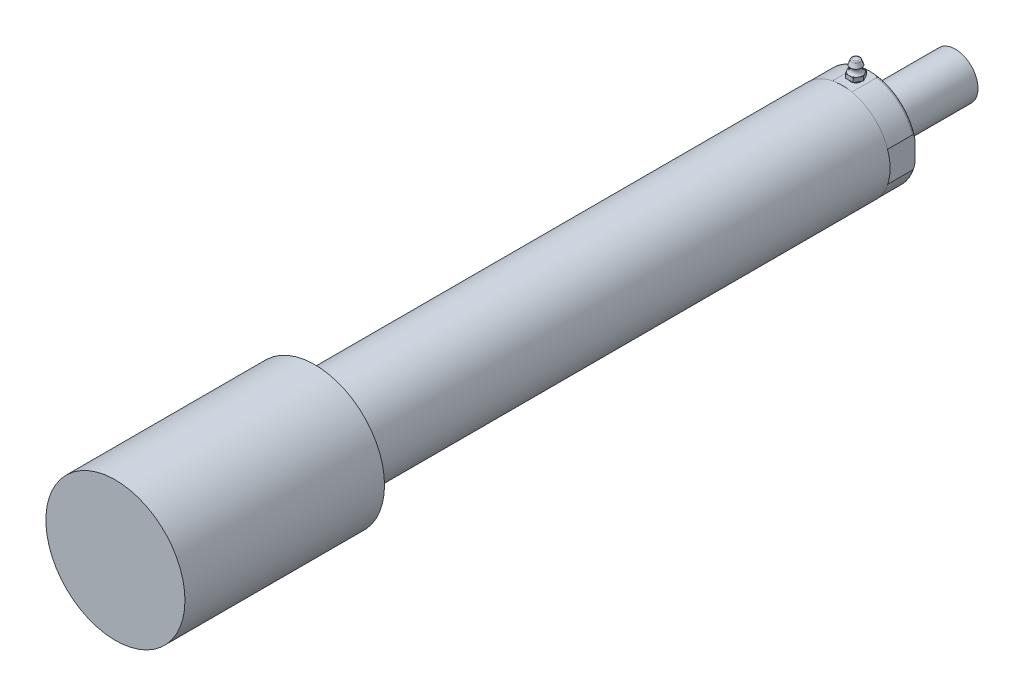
ISO-10303-21;
HEADER;
FILE_DESCRIPTION(('STEP AP214'),'2;1');
FILE_NAME('part.step','',(''),(''),'','','');
FILE_SCHEMA(('AUTOMOTIVE_DESIGN { 1 0 10303 214 1 1 1 1 }'));
ENDSEC;
DATA;
#1=APPLICATION_CONTEXT('core data for automotive mechanical design processes');
#2=APPLICATION_PROTOCOL_DEFINITION('international standard','automotive_design',2000,#1);
#3=PRODUCT_CONTEXT('',#1,'mechanical');
#4=PRODUCT('Part','Part','',(#3));
#5=PRODUCT_RELATED_PRODUCT_CATEGORY('part','',(#4));
#6=PRODUCT_DEFINITION_FORMATION('','',#4);
#7=PRODUCT_DEFINITION_CONTEXT('part definition',#1,'design');
#8=PRODUCT_DEFINITION('design','',#6,#7);
#9=PRODUCT_DEFINITION_SHAPE('','',#8);
#10=(LENGTH_UNIT() NAMED_UNIT(*) SI_UNIT(.MILLI.,.METRE.));
#11=(NAMED_UNIT(*) PLANE_ANGLE_UNIT() SI_UNIT($,.RADIAN.));
#12=(NAMED_UNIT(*) SI_UNIT($,.STERADIAN.) SOLID_ANGLE_UNIT());
#13=UNCERTAINTY_MEASURE_WITH_UNIT(LENGTH_MEASURE(1.E-05),#10,'distance_accuracy_value','');
#14=(GEOMETRIC_REPRESENTATION_CONTEXT(3) GLOBAL_UNCERTAINTY_ASSIGNED_CONTEXT((#13)) GLOBAL_UNIT_ASSIGNED_CONTEXT((#10,
#11,#12)) REPRESENTATION_CONTEXT('',''));
#15=CARTESIAN_POINT('',(0.,0.,0.));
#16=DIRECTION('',(0.,0.,1.));
#17=DIRECTION('',(1.,0.,0.));
#18=AXIS2_PLACEMENT_3D('',#15,#16,#17);
#19=CARTESIAN_POINT('',(0.,0.,-14.7828));
#20=DIRECTION('',(0.,0.,1.));
#21=DIRECTION('',(1.,0.,0.));
#22=AXIS2_PLACEMENT_3D('',#19,#20,#21);
#23=PLANE('',#22);
#24=CARTESIAN_POINT('',(0.,0.,-14.7828));
#25=DIRECTION('',(0.,0.,1.));
#26=DIRECTION('',(1.,0.,0.));
#27=AXIS2_PLACEMENT_3D('',#24,#25,#26);
#28=CIRCLE('',#27,28.56738);
#29=CARTESIAN_POINT('',(28.56738,0.,-14.7828));
#30=VERTEX_POINT('',#29);
#31=EDGE_CURVE('E10',#30,#30,#28,.T.);
#32=ORIENTED_EDGE('',*,*,#31,.T.);
#33=EDGE_LOOP('',(#32));
#34=FACE_BOUND('',#33,.T.);
#35=CARTESIAN_POINT('',(0.,0.,-14.7828));
#36=DIRECTION('',(0.,0.,1.));
#37=DIRECTION('',(1.,0.,0.));
#38=AXIS2_PLACEMENT_3D('',#35,#36,#37);
#39=CIRCLE('',#38,41.32961);
#40=CARTESIAN_POINT('',(41.32961,0.,-14.7828));
#41=VERTEX_POINT('',#40);
#42=EDGE_CURVE('E311',#41,#41,#39,.T.);
#43=ORIENTED_EDGE('',*,*,#42,.F.);
#44=EDGE_LOOP('',(#43));
#45=FACE_BOUND('',#44,.T.);
#46=ADVANCED_FACE('F16',(#34,#45),#23,.F.);
#47=CARTESIAN_POINT('',(0.,38.037384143,-336.258399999));
#48=DIRECTION('',(0.,1.,0.));
#49=DIRECTION('',(0.,0.,1.));
#50=AXIS2_PLACEMENT_3D('',#47,#48,#49);
#51=PLANE('',#50);
#52=CARTESIAN_POINT('',(0.,38.037384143,-336.258399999));
#53=DIRECTION('',(0.,1.,0.));
#54=DIRECTION('',(0.,0.,1.));
#55=AXIS2_PLACEMENT_3D('',#52,#53,#54);
#56=CIRCLE('',#55,1.7474960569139);
#57=CARTESIAN_POINT('',(0.,38.037384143,-334.510903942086));
#58=VERTEX_POINT('',#57);
#59=EDGE_CURVE('E222',#58,#58,#56,.T.);
#60=ORIENTED_EDGE('',*,*,#59,.T.);
#61=EDGE_LOOP('',(#60));
#62=FACE_BOUND('',#61,.T.);
#63=ADVANCED_FACE('F248',(#62),#51,.T.);
#64=CARTESIAN_POINT('',(0.,37.275384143,-336.258399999));
#65=DIRECTION('',(0.,1.,0.));
#66=DIRECTION('',(0.,0.,1.));
#67=AXIS2_PLACEMENT_3D('',#64,#65,#66);
#68=TOROIDAL_SURFACE('',#67,1.7474960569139,0.762);
#69=ORIENTED_EDGE('',*,*,#59,.F.);
#70=EDGE_LOOP('',(#69));
#71=FACE_BOUND('',#70,.T.);
#72=CARTESIAN_POINT('',(0.,37.5297756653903,-336.258399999));
#73=DIRECTION('',(0.,1.,0.));
#74=DIRECTION('',(0.,0.,1.));
#75=AXIS2_PLACEMENT_3D('',#72,#73,#74);
#76=CIRCLE('',#75,2.46577800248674);
#77=CARTESIAN_POINT('',(0.,37.5297756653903,-333.792621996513));
#78=VERTEX_POINT('',#77);
#79=EDGE_CURVE('E219',#78,#78,#76,.F.);
#80=ORIENTED_EDGE('',*,*,#79,.F.);
#81=EDGE_LOOP('',(#80));
#82=FACE_BOUND('',#81,.T.);
#83=ADVANCED_FACE('F244',(#71,#82),#68,.T.);
#84=CARTESIAN_POINT('',(0.,34.989384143,-336.258399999));
#85=DIRECTION('',(0.,-1.,0.));
#86=DIRECTION('',(0.,0.,-1.));
#87=AXIS2_PLACEMENT_3D('',#84,#85,#86);
#88=CONICAL_SURFACE('',#87,3.3655,0.340381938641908);
#89=ORIENTED_EDGE('',*,*,#79,.T.);
#90=EDGE_LOOP('',(#89));
#91=FACE_BOUND('',#90,.T.);
#92=CARTESIAN_POINT('',(0.,34.989384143,-336.258399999));
#93=DIRECTION('',(0.,-1.,0.));
#94=DIRECTION('',(0.,0.,-1.));
#95=AXIS2_PLACEMENT_3D('',#92,#93,#94);
#96=CIRCLE('',#95,3.3655);
#97=CARTESIAN_POINT('',(0.,34.989384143,-339.623899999));
#98=VERTEX_POINT('',#97);
#99=EDGE_CURVE('E172',#98,#98,#96,.T.);
#100=ORIENTED_EDGE('',*,*,#99,.F.);
#101=EDGE_LOOP('',(#100));
#102=FACE_BOUND('',#101,.T.);
#103=ADVANCED_FACE('F247',(#91,#102),#88,.T.);
#104=CARTESIAN_POINT('',(0.,33.3910743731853,-336.258399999));
#105=DIRECTION('',(0.,-1.,0.));
#106=DIRECTION('',(0.,0.,-1.));
#107=AXIS2_PLACEMENT_3D('',#104,#105,#106);
#108=TOROIDAL_SURFACE('',#107,5.20693450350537,2.43833450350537);
#109=ORIENTED_EDGE('',*,*,#99,.T.);
#110=EDGE_LOOP('',(#109));
#111=FACE_BOUND('',#110,.T.);
#112=CARTESIAN_POINT('',(0.,31.290509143,-336.258399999));
#113=DIRECTION('',(0.,-1.,0.));
#114=DIRECTION('',(0.,0.,-1.));
#115=AXIS2_PLACEMENT_3D('',#112,#113,#114);
#116=CIRCLE('',#115,3.96875);
#117=CARTESIAN_POINT('',(0.,31.290509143,-340.227149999));
#118=VERTEX_POINT('',#117);
#119=CARTESIAN_POINT('',(3.43703832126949,31.290509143,-338.242774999));
#120=VERTEX_POINT('',#119);
#121=EDGE_CURVE('E35',#118,#120,#116,.T.);
#122=ORIENTED_EDGE('',*,*,#121,.F.);
#123=CARTESIAN_POINT('',(-3.4370383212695,31.290509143,-338.242774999));
#124=VERTEX_POINT('',#123);
#125=EDGE_CURVE('E168',#124,#118,#116,.T.);
#126=ORIENTED_EDGE('',*,*,#125,.F.);
#127=CARTESIAN_POINT('',(-3.43703832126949,31.290509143,-334.274024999));
#128=VERTEX_POINT('',#127);
#129=EDGE_CURVE('E167',#128,#124,#116,.T.);
#130=ORIENTED_EDGE('',*,*,#129,.F.);
#131=CARTESIAN_POINT('',(0.,31.290509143,-332.289649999));
#132=VERTEX_POINT('',#131);
#133=EDGE_CURVE('E147',#132,#128,#116,.T.);
#134=ORIENTED_EDGE('',*,*,#133,.F.);
#135=CARTESIAN_POINT('',(3.43703832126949,31.290509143,-334.274024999));
#136=VERTEX_POINT('',#135);
#137=EDGE_CURVE('E136',#136,#132,#116,.T.);
#138=ORIENTED_EDGE('',*,*,#137,.F.);
#139=EDGE_CURVE('E146',#120,#136,#116,.T.);
#140=ORIENTED_EDGE('',*,*,#139,.F.);
#141=EDGE_LOOP('',(#122,#126,#130,#134,#138,#140));
#142=FACE_BOUND('',#141,.T.);
#143=ADVANCED_FACE('F165',(#111,#142),#108,.F.);
#144=CARTESIAN_POINT('',(-2.29135888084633,31.290509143,-340.227149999));
#145=DIRECTION('',(0.,1.,0.));
#146=DIRECTION('',(1.,0.,0.));
#147=AXIS2_PLACEMENT_3D('',#144,#145,#146);
#148=PLANE('',#147);
#149=ORIENTED_EDGE('',*,*,#129,.T.);
#150=DIRECTION('',(-0.5,0.,0.866025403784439));
#151=VECTOR('',#150,1.);
#152=CARTESIAN_POINT('',(-2.29135888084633,31.290509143,-340.227149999));
#153=LINE('',#152,#151);
#154=CARTESIAN_POINT('',(-4.58271776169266,31.290509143,-336.258399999));
#155=VERTEX_POINT('',#154);
#156=EDGE_CURVE('E181',#124,#155,#153,.T.);
#157=ORIENTED_EDGE('',*,*,#156,.T.);
#158=DIRECTION('',(0.5,0.,0.866025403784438));
#159=VECTOR('',#158,1.);
#160=CARTESIAN_POINT('',(-4.58271776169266,31.290509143,-336.258399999));
#161=LINE('',#160,#159);
#162=EDGE_CURVE('E92',#155,#128,#161,.T.);
#163=ORIENTED_EDGE('',*,*,#162,.T.);
#164=EDGE_LOOP('',(#149,#157,#163));
#165=FACE_BOUND('',#164,.T.);
#166=ADVANCED_FACE('F280',(#165),#148,.T.);
#167=ORIENTED_EDGE('',*,*,#133,.T.);
#168=CARTESIAN_POINT('',(-2.29135888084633,31.290509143,-332.289649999));
#169=VERTEX_POINT('',#168);
#170=EDGE_CURVE('E162',#128,#169,#161,.T.);
#171=ORIENTED_EDGE('',*,*,#170,.T.);
#172=DIRECTION('',(1.,0.,0.));
#173=VECTOR('',#172,1.);
#174=CARTESIAN_POINT('',(-2.29135888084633,31.290509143,-332.289649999));
#175=LINE('',#174,#173);
#176=EDGE_CURVE('E154',#169,#132,#175,.T.);
#177=ORIENTED_EDGE('',*,*,#176,.T.);
#178=EDGE_LOOP('',(#167,#171,#177));
#179=FACE_BOUND('',#178,.T.);
#180=ADVANCED_FACE('F160',(#179),#148,.T.);
#181=ORIENTED_EDGE('',*,*,#137,.T.);
#182=CARTESIAN_POINT('',(2.29135888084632,31.290509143,-332.289649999));
#183=VERTEX_POINT('',#182);
#184=EDGE_CURVE('E139',#132,#183,#175,.T.);
#185=ORIENTED_EDGE('',*,*,#184,.T.);
#186=DIRECTION('',(0.5,0.,-0.866025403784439));
#187=VECTOR('',#186,1.);
#188=CARTESIAN_POINT('',(2.29135888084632,31.290509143,-332.289649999));
#189=LINE('',#188,#187);
#190=EDGE_CURVE('E142',#183,#136,#189,.T.);
#191=ORIENTED_EDGE('',*,*,#190,.T.);
#192=EDGE_LOOP('',(#181,#185,#191));
#193=FACE_BOUND('',#192,.T.);
#194=ADVANCED_FACE('F138',(#193),#148,.T.);
#195=ORIENTED_EDGE('',*,*,#139,.T.);
#196=CARTESIAN_POINT('',(4.58271776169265,31.290509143,-336.258399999));
#197=VERTEX_POINT('',#196);
#198=EDGE_CURVE('E164',#136,#197,#189,.T.);
#199=ORIENTED_EDGE('',*,*,#198,.T.);
#200=DIRECTION('',(-0.5,0.,-0.866025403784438));
#201=VECTOR('',#200,1.);
#202=CARTESIAN_POINT('',(4.58271776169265,31.290509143,-336.258399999));
#203=LINE('',#202,#201);
#204=EDGE_CURVE('E189',#197,#120,#203,.T.);
#205=ORIENTED_EDGE('',*,*,#204,.T.);
#206=EDGE_LOOP('',(#195,#199,#205));
#207=FACE_BOUND('',#206,.T.);
#208=ADVANCED_FACE('F625',(#207),#148,.T.);
#209=ORIENTED_EDGE('',*,*,#121,.T.);
#210=CARTESIAN_POINT('',(2.29135888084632,31.290509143,-340.227149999));
#211=VERTEX_POINT('',#210);
#212=EDGE_CURVE('E188',#120,#211,#203,.T.);
#213=ORIENTED_EDGE('',*,*,#212,.T.);
#214=DIRECTION('',(-1.,0.,0.));
#215=VECTOR('',#214,1.);
#216=CARTESIAN_POINT('',(2.29135888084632,31.290509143,-340.227149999));
#217=LINE('',#216,#215);
#218=EDGE_CURVE('E179',#211,#118,#217,.T.);
#219=ORIENTED_EDGE('',*,*,#218,.T.);
#220=EDGE_LOOP('',(#209,#213,#219));
#221=FACE_BOUND('',#220,.T.);
#222=ADVANCED_FACE('F614',(#221),#148,.T.);
#223=ORIENTED_EDGE('',*,*,#125,.T.);
#224=CARTESIAN_POINT('',(-2.29135888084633,31.290509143,-340.227149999));
#225=VERTEX_POINT('',#224);
#226=EDGE_CURVE('E182',#118,#225,#217,.T.);
#227=ORIENTED_EDGE('',*,*,#226,.T.);
#228=EDGE_CURVE('E183',#225,#124,#153,.T.);
#229=ORIENTED_EDGE('',*,*,#228,.T.);
#230=EDGE_LOOP('',(#223,#227,#229));
#231=FACE_BOUND('',#230,.T.);
#232=ADVANCED_FACE('F261',(#231),#148,.T.);
#233=CARTESIAN_POINT('',(-2.29135888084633,31.290509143,-340.227149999));
#234=DIRECTION('',(0.866025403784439,0.,0.5));
#235=DIRECTION('',(0.5,0.,-0.866025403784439));
#236=AXIS2_PLACEMENT_3D('',#233,#234,#235);
#237=PLANE('',#236);
#238=DIRECTION('',(-0.5,0.,0.866025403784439));
#239=VECTOR('',#238,1.);
#240=CARTESIAN_POINT('',(-2.29135888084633,28.909259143,-340.227149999));
#241=LINE('',#240,#239);
#242=CARTESIAN_POINT('',(-2.29135888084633,28.909259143,-340.227149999));
#243=VERTEX_POINT('',#242);
#244=CARTESIAN_POINT('',(-4.58271776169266,28.909259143,-336.258399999));
#245=VERTEX_POINT('',#244);
#246=EDGE_CURVE('E195',#243,#245,#241,.T.);
#247=ORIENTED_EDGE('',*,*,#246,.T.);
#248=DIRECTION('',(0.,-1.,0.));
#249=VECTOR('',#248,1.);
#250=CARTESIAN_POINT('',(-4.58271776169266,31.290509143,-336.258399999));
#251=LINE('',#250,#249);
#252=EDGE_CURVE('E213',#155,#245,#251,.T.);
#253=ORIENTED_EDGE('',*,*,#252,.F.);
#254=ORIENTED_EDGE('',*,*,#156,.F.);
#255=ORIENTED_EDGE('',*,*,#228,.F.);
#256=DIRECTION('',(0.,-1.,0.));
#257=VECTOR('',#256,1.);
#258=CARTESIAN_POINT('',(-2.29135888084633,31.290509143,-340.227149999));
#259=LINE('',#258,#257);
#260=EDGE_CURVE('E216',#225,#243,#259,.T.);
#261=ORIENTED_EDGE('',*,*,#260,.T.);
#262=EDGE_LOOP('',(#247,#253,#254,#255,#261));
#263=FACE_BOUND('',#262,.T.);
#264=ADVANCED_FACE('F257',(#263),#237,.F.);
#265=CARTESIAN_POINT('',(-4.58271776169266,31.290509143,-336.258399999));
#266=DIRECTION('',(0.866025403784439,0.,-0.5));
#267=DIRECTION('',(-0.5,0.,-0.866025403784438));
#268=AXIS2_PLACEMENT_3D('',#265,#266,#267);
#269=PLANE('',#268);
#270=DIRECTION('',(0.5,0.,0.866025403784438));
#271=VECTOR('',#270,1.);
#272=CARTESIAN_POINT('',(-4.58271776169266,28.909259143,-336.258399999));
#273=LINE('',#272,#271);
#274=CARTESIAN_POINT('',(-2.29135888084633,28.909259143,-332.289649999));
#275=VERTEX_POINT('',#274);
#276=EDGE_CURVE('E197',#245,#275,#273,.T.);
#277=ORIENTED_EDGE('',*,*,#276,.T.);
#278=DIRECTION('',(0.,-1.,0.));
#279=VECTOR('',#278,1.);
#280=CARTESIAN_POINT('',(-2.29135888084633,31.290509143,-332.289649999));
#281=LINE('',#280,#279);
#282=EDGE_CURVE('E211',#169,#275,#281,.T.);
#283=ORIENTED_EDGE('',*,*,#282,.F.);
#284=ORIENTED_EDGE('',*,*,#170,.F.);
#285=ORIENTED_EDGE('',*,*,#162,.F.);
#286=ORIENTED_EDGE('',*,*,#252,.T.);
#287=EDGE_LOOP('',(#277,#283,#284,#285,#286));
#288=FACE_BOUND('',#287,.T.);
#289=ADVANCED_FACE('F260',(#288),#269,.F.);
#290=CARTESIAN_POINT('',(-2.29135888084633,31.290509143,-332.289649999));
#291=DIRECTION('',(0.,0.,-1.));
#292=DIRECTION('',(-1.,0.,0.));
#293=AXIS2_PLACEMENT_3D('',#290,#291,#292);
#294=PLANE('',#293);
#295=DIRECTION('',(1.,0.,0.));
#296=VECTOR('',#295,1.);
#297=CARTESIAN_POINT('',(-2.29135888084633,28.909259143,-332.289649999));
#298=LINE('',#297,#296);
#299=CARTESIAN_POINT('',(2.29135888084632,28.909259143,-332.289649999));
#300=VERTEX_POINT('',#299);
#301=EDGE_CURVE('E199',#275,#300,#298,.T.);
#302=ORIENTED_EDGE('',*,*,#301,.T.);
#303=DIRECTION('',(0.,-1.,0.));
#304=VECTOR('',#303,1.);
#305=CARTESIAN_POINT('',(2.29135888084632,31.290509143,-332.289649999));
#306=LINE('',#305,#304);
#307=EDGE_CURVE('E156',#183,#300,#306,.T.);
#308=ORIENTED_EDGE('',*,*,#307,.F.);
#309=ORIENTED_EDGE('',*,*,#184,.F.);
#310=ORIENTED_EDGE('',*,*,#176,.F.);
#311=ORIENTED_EDGE('',*,*,#282,.T.);
#312=EDGE_LOOP('',(#302,#308,#309,#310,#311));
#313=FACE_BOUND('',#312,.T.);
#314=ADVANCED_FACE('F152',(#313),#294,.F.);
#315=CARTESIAN_POINT('',(2.29135888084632,31.290509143,-332.289649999));
#316=DIRECTION('',(-0.866025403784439,0.,-0.5));
#317=DIRECTION('',(-0.5,0.,0.866025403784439));
#318=AXIS2_PLACEMENT_3D('',#315,#316,#317);
#319=PLANE('',#318);
#320=DIRECTION('',(0.5,0.,-0.866025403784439));
#321=VECTOR('',#320,1.);
#322=CARTESIAN_POINT('',(2.29135888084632,28.909259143,-332.289649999));
#323=LINE('',#322,#321);
#324=CARTESIAN_POINT('',(4.58271776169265,28.909259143,-336.258399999));
#325=VERTEX_POINT('',#324);
#326=EDGE_CURVE('E201',#300,#325,#323,.T.);
#327=ORIENTED_EDGE('',*,*,#326,.T.);
#328=DIRECTION('',(0.,-1.,0.));
#329=VECTOR('',#328,1.);
#330=CARTESIAN_POINT('',(4.58271776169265,31.290509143,-336.258399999));
#331=LINE('',#330,#329);
#332=EDGE_CURVE('E207',#197,#325,#331,.T.);
#333=ORIENTED_EDGE('',*,*,#332,.F.);
#334=ORIENTED_EDGE('',*,*,#198,.F.);
#335=ORIENTED_EDGE('',*,*,#190,.F.);
#336=ORIENTED_EDGE('',*,*,#307,.T.);
#337=EDGE_LOOP('',(#327,#333,#334,#335,#336));
#338=FACE_BOUND('',#337,.T.);
#339=ADVANCED_FACE('F268',(#338),#319,.F.);
#340=CARTESIAN_POINT('',(4.58271776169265,31.290509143,-336.258399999));
#341=DIRECTION('',(-0.866025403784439,0.,0.5));
#342=DIRECTION('',(0.5,0.,0.866025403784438));
#343=AXIS2_PLACEMENT_3D('',#340,#341,#342);
#344=PLANE('',#343);
#345=DIRECTION('',(-0.5,0.,-0.866025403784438));
#346=VECTOR('',#345,1.);
#347=CARTESIAN_POINT('',(4.58271776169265,28.909259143,-336.258399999));
#348=LINE('',#347,#346);
#349=CARTESIAN_POINT('',(2.29135888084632,28.909259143,-340.227149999));
#350=VERTEX_POINT('',#349);
#351=EDGE_CURVE('E203',#325,#350,#348,.T.);
#352=ORIENTED_EDGE('',*,*,#351,.T.);
#353=DIRECTION('',(0.,-1.,0.));
#354=VECTOR('',#353,1.);
#355=CARTESIAN_POINT('',(2.29135888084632,31.290509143,-340.227149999));
#356=LINE('',#355,#354);
#357=EDGE_CURVE('E192',#211,#350,#356,.T.);
#358=ORIENTED_EDGE('',*,*,#357,.F.);
#359=ORIENTED_EDGE('',*,*,#212,.F.);
#360=ORIENTED_EDGE('',*,*,#204,.F.);
#361=ORIENTED_EDGE('',*,*,#332,.T.);
#362=EDGE_LOOP('',(#352,#358,#359,#360,#361));
#363=FACE_BOUND('',#362,.T.);
#364=ADVANCED_FACE('F254',(#363),#344,.F.);
#365=CARTESIAN_POINT('',(2.29135888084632,31.290509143,-340.227149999));
#366=DIRECTION('',(0.,0.,1.));
#367=DIRECTION('',(0.,-1.,0.));
#368=AXIS2_PLACEMENT_3D('',#365,#366,#367);
#369=PLANE('',#368);
#370=DIRECTION('',(-1.,0.,0.));
#371=VECTOR('',#370,1.);
#372=CARTESIAN_POINT('',(2.29135888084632,28.909259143,-340.227149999));
#373=LINE('',#372,#371);
#374=EDGE_CURVE('E178',#350,#243,#373,.T.);
#375=ORIENTED_EDGE('',*,*,#374,.T.);
#376=ORIENTED_EDGE('',*,*,#260,.F.);
#377=ORIENTED_EDGE('',*,*,#226,.F.);
#378=ORIENTED_EDGE('',*,*,#218,.F.);
#379=ORIENTED_EDGE('',*,*,#357,.T.);
#380=EDGE_LOOP('',(#375,#376,#377,#378,#379));
#381=FACE_BOUND('',#380,.T.);
#382=ADVANCED_FACE('F250',(#381),#369,.F.);
#383=CARTESIAN_POINT('',(0.,13.5,-395.313399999));
#384=DIRECTION('',(0.,0.,1.));
#385=DIRECTION('',(0.,1.,0.));
#386=AXIS2_PLACEMENT_3D('',#383,#384,#385);
#387=PLANE('',#386);
#388=CARTESIAN_POINT('',(0.,0.,-395.313399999));
#389=DIRECTION('',(0.,0.,-1.));
#390=DIRECTION('',(0.,-1.,0.));
#391=AXIS2_PLACEMENT_3D('',#388,#389,#390);
#392=CIRCLE('',#391,13.5);
#393=CARTESIAN_POINT('',(0.,-13.5,-395.313399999));
#394=VERTEX_POINT('',#393);
#395=EDGE_CURVE('E331',#394,#394,#392,.T.);
#396=ORIENTED_EDGE('',*,*,#395,.T.);
#397=EDGE_LOOP('',(#396));
#398=FACE_BOUND('',#397,.T.);
#399=ADVANCED_FACE('F253',(#398),#387,.F.);
#400=CARTESIAN_POINT('',(-2.29135888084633,28.909259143,-340.227149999));
#401=DIRECTION('',(0.,1.,0.));
#402=DIRECTION('',(1.,0.,0.));
#403=AXIS2_PLACEMENT_3D('',#400,#401,#402);
#404=PLANE('',#403);
#405=CARTESIAN_POINT('',(0.,28.909259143,-336.258399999));
#406=DIRECTION('',(0.,-1.,0.));
#407=DIRECTION('',(0.,0.,-1.));
#408=AXIS2_PLACEMENT_3D('',#405,#406,#407);
#409=CIRCLE('',#408,3.2385);
#410=CARTESIAN_POINT('',(0.,28.909259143,-339.496899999));
#411=VERTEX_POINT('',#410);
#412=EDGE_CURVE('E171',#411,#411,#409,.T.);
#413=ORIENTED_EDGE('',*,*,#412,.F.);
#414=EDGE_LOOP('',(#413));
#415=FACE_BOUND('',#414,.T.);
#416=ORIENTED_EDGE('',*,*,#374,.F.);
#417=ORIENTED_EDGE('',*,*,#351,.F.);
#418=ORIENTED_EDGE('',*,*,#326,.F.);
#419=ORIENTED_EDGE('',*,*,#301,.F.);
#420=ORIENTED_EDGE('',*,*,#276,.F.);
#421=ORIENTED_EDGE('',*,*,#246,.F.);
#422=EDGE_LOOP('',(#416,#417,#418,#419,#420,#421));
#423=FACE_BOUND('',#422,.T.);
#424=ADVANCED_FACE('F256',(#415,#423),#404,.F.);
#425=CARTESIAN_POINT('',(0.,0.,-345.427612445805));
#426=DIRECTION('',(0.,0.,-1.));
#427=DIRECTION('',(0.,-1.,0.));
#428=AXIS2_PLACEMENT_3D('',#425,#426,#427);
#429=CYLINDRICAL_SURFACE('',#428,13.5);
#430=ORIENTED_EDGE('',*,*,#395,.F.);
#431=EDGE_LOOP('',(#430));
#432=FACE_BOUND('',#431,.T.);
#433=CARTESIAN_POINT('',(0.,0.,-344.513399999));
#434=DIRECTION('',(0.,0.,-1.));
#435=DIRECTION('',(0.,-1.,0.));
#436=AXIS2_PLACEMENT_3D('',#433,#434,#435);
#437=CIRCLE('',#436,13.5);
#438=CARTESIAN_POINT('',(0.,-13.5,-344.513399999));
#439=VERTEX_POINT('',#438);
#440=EDGE_CURVE('E328',#439,#439,#437,.T.);
#441=ORIENTED_EDGE('',*,*,#440,.T.);
#442=EDGE_LOOP('',(#441));
#443=FACE_BOUND('',#442,.T.);
#444=ADVANCED_FACE('F277',(#432,#443),#429,.T.);
#445=CARTESIAN_POINT('',(0.,28.909259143,-336.258399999));
#446=DIRECTION('',(0.,-1.,0.));
#447=DIRECTION('',(0.,0.,-1.));
#448=AXIS2_PLACEMENT_3D('',#445,#446,#447);
#449=CYLINDRICAL_SURFACE('',#448,3.2385);
#450=ORIENTED_EDGE('',*,*,#412,.T.);
#451=EDGE_LOOP('',(#450));
#452=FACE_BOUND('',#451,.T.);
#453=CARTESIAN_POINT('',(0.,28.401259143,-336.258399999));
#454=DIRECTION('',(0.,-1.,0.));
#455=DIRECTION('',(0.,0.,-1.));
#456=AXIS2_PLACEMENT_3D('',#453,#454,#455);
#457=CIRCLE('',#456,3.2385);
#458=CARTESIAN_POINT('',(0.,28.401259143,-339.496899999));
#459=VERTEX_POINT('',#458);
#460=EDGE_CURVE('E175',#459,#459,#457,.T.);
#461=ORIENTED_EDGE('',*,*,#460,.F.);
#462=EDGE_LOOP('',(#461));
#463=FACE_BOUND('',#462,.T.);
#464=ADVANCED_FACE('F279',(#452,#463),#449,.T.);
#465=CARTESIAN_POINT('',(0.,13.5,-344.513399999));
#466=DIRECTION('',(0.,0.,1.));
#467=DIRECTION('',(0.,1.,0.));
#468=AXIS2_PLACEMENT_3D('',#465,#466,#467);
#469=PLANE('',#468);
#470=CARTESIAN_POINT('',(0.,0.,-344.513399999));
#471=DIRECTION('',(0.,0.,1.));
#472=DIRECTION('',(0.,1.,0.));
#473=AXIS2_PLACEMENT_3D('',#470,#471,#472);
#474=CIRCLE('',#473,26.8732);
#475=CARTESIAN_POINT('',(0.,26.8732,-344.513399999));
#476=VERTEX_POINT('',#475);
#477=EDGE_CURVE('E321',#476,#476,#474,.F.);
#478=ORIENTED_EDGE('',*,*,#477,.T.);
#479=EDGE_LOOP('',(#478));
#480=FACE_BOUND('',#479,.T.);
#481=ORIENTED_EDGE('',*,*,#440,.F.);
#482=EDGE_LOOP('',(#481));
#483=FACE_BOUND('',#482,.T.);
#484=ADVANCED_FACE('F293',(#480,#483),#469,.F.);
#485=CARTESIAN_POINT('',(0.,24.146759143,-336.258399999));
#486=DIRECTION('',(0.,1.,0.));
#487=DIRECTION('',(0.,0.,1.));
#488=AXIS2_PLACEMENT_3D('',#485,#486,#487);
#489=CONICAL_SURFACE('',#488,3.048,0.0447462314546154);
#490=ORIENTED_EDGE('',*,*,#460,.T.);
#491=EDGE_LOOP('',(#490));
#492=FACE_BOUND('',#491,.T.);
#493=CARTESIAN_POINT('',(0.,27.877384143,-336.258399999));
#494=DIRECTION('',(0.,-1.,0.));
#495=DIRECTION('',(0.,0.,-1.));
#496=AXIS2_PLACEMENT_3D('',#493,#494,#495);
#497=CIRCLE('',#496,3.21504291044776);
#498=CARTESIAN_POINT('',(0.,27.877384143,-339.473442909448));
#499=VERTEX_POINT('',#498);
#500=EDGE_CURVE('E26',#499,#499,#497,.F.);
#501=ORIENTED_EDGE('',*,*,#500,.T.);
#502=EDGE_LOOP('',(#501));
#503=FACE_BOUND('',#502,.T.);
#504=ADVANCED_FACE('F289',(#492,#503),#489,.T.);
#505=CARTESIAN_POINT('',(0.,0.,-342.925899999));
#506=DIRECTION('',(0.,0.,1.));
#507=DIRECTION('',(0.,1.,0.));
#508=AXIS2_PLACEMENT_3D('',#505,#506,#507);
#509=TOROIDAL_SURFACE('',#508,26.8732,1.5875);
#510=CARTESIAN_POINT('',(0.,27.877384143,-344.155440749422));
#511=CARTESIAN_POINT('',(0.265451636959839,27.877384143,-344.155444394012));
#512=CARTESIAN_POINT('',(0.53090729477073,27.877384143,-344.152373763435));
#513=CARTESIAN_POINT('',(1.06176129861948,27.877384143,-344.139756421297));
#514=CARTESIAN_POINT('',(1.32715958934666,27.877384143,-344.130207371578));
#515=CARTESIAN_POINT('',(1.85687288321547,27.877384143,-344.103595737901));
#516=CARTESIAN_POINT('',(2.12118885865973,27.877384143,-344.086553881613));
#517=CARTESIAN_POINT('',(2.51701883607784,27.877384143,-344.053770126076));
#518=CARTESIAN_POINT('',(2.64883358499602,27.877384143,-344.041641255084));
#519=CARTESIAN_POINT('',(2.91216948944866,27.877384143,-344.014552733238));
#520=CARTESIAN_POINT('',(3.04369065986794,27.877384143,-343.999593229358));
#521=CARTESIAN_POINT('',(3.30644207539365,27.877384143,-343.966278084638));
#522=CARTESIAN_POINT('',(3.43767189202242,27.877384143,-343.947919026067));
#523=CARTESIAN_POINT('',(3.69954531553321,27.877384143,-343.907032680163));
#524=CARTESIAN_POINT('',(3.83018867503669,27.877384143,-343.884503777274));
#525=CARTESIAN_POINT('',(4.09106564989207,27.877384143,-343.834027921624));
#526=CARTESIAN_POINT('',(4.22129454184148,27.877384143,-343.806056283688));
#527=CARTESIAN_POINT('',(4.47997147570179,27.877384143,-343.743022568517));
#528=CARTESIAN_POINT('',(4.60842108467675,27.877384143,-343.707967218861));
#529=CARTESIAN_POINT('',(4.79927752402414,27.877384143,-343.647480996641));
#530=CARTESIAN_POINT('',(4.86289331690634,27.877384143,-343.625879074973));
#531=CARTESIAN_POINT('',(4.98899922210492,27.877384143,-343.579322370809));
#532=CARTESIAN_POINT('',(5.05148784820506,27.877384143,-343.55436348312));
#533=CARTESIAN_POINT('',(5.17407169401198,27.877384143,-343.500334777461));
#534=CARTESIAN_POINT('',(5.2341822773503,27.877384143,-343.471300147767));
#535=CARTESIAN_POINT('',(5.35121093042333,27.877384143,-343.407465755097));
#536=CARTESIAN_POINT('',(5.40813744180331,27.8773841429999,-343.372682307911));
#537=CARTESIAN_POINT('',(5.49062571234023,27.877384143,-343.31297972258));
#538=CARTESIAN_POINT('',(5.51836475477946,27.877384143,-343.291096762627));
#539=CARTESIAN_POINT('',(5.57124738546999,27.877384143,-343.24431568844));
#540=CARTESIAN_POINT('',(5.59639184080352,27.877384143,-343.219418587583));
#541=CARTESIAN_POINT('',(5.63639683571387,27.877384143,-343.173043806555));
#542=CARTESIAN_POINT('',(5.65221770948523,27.877384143,-343.152405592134));
#543=CARTESIAN_POINT('',(5.68057732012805,27.877384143,-343.1089682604));
#544=CARTESIAN_POINT('',(5.69312260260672,27.877384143,-343.086173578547));
#545=CARTESIAN_POINT('',(5.71098724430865,27.877384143,-343.044673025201));
#546=CARTESIAN_POINT('',(5.71733435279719,27.877384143,-343.026415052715));
#547=CARTESIAN_POINT('',(5.7269117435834,27.877384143,-342.989100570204));
#548=CARTESIAN_POINT('',(5.73014607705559,27.877384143,-342.970045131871));
#549=CARTESIAN_POINT('',(5.73314750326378,27.877384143,-342.931569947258));
#550=CARTESIAN_POINT('',(5.73289923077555,27.877384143,-342.91214896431));
#551=CARTESIAN_POINT('',(5.72892948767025,27.877384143,-342.873663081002));
#552=CARTESIAN_POINT('',(5.72520527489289,27.877384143,-342.854598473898));
#553=CARTESIAN_POINT('',(5.71370799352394,27.877384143,-342.813864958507));
#554=CARTESIAN_POINT('',(5.70530791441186,27.877384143,-342.792375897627));
#555=CARTESIAN_POINT('',(5.6851612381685,27.877384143,-342.751037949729));
#556=CARTESIAN_POINT('',(5.67340817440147,27.877384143,-342.731192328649));
#557=CARTESIAN_POINT('',(5.63933893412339,27.877384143,-342.681279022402));
#558=CARTESIAN_POINT('',(5.61501828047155,27.877384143,-342.65259740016));
#559=CARTESIAN_POINT('',(5.56255217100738,27.877384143,-342.599018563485));
#560=CARTESIAN_POINT('',(5.53439592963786,27.877384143,-342.574132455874));
#561=CARTESIAN_POINT('',(5.46534305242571,27.877384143,-342.519119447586));
#562=CARTESIAN_POINT('',(5.42345975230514,27.877384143,-342.490247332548));
#563=CARTESIAN_POINT('',(5.3371432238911,27.877384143,-342.436545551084));
#564=CARTESIAN_POINT('',(5.29270492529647,27.877384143,-342.411724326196));
#565=CARTESIAN_POINT('',(5.2019985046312,27.877384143,-342.36508901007));
#566=CARTESIAN_POINT('',(5.15572197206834,27.877384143,-342.343291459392));
#567=CARTESIAN_POINT('',(5.06213183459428,27.877384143,-342.302221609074));
#568=CARTESIAN_POINT('',(5.01481929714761,27.877384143,-342.282946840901));
#569=CARTESIAN_POINT('',(4.88126731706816,27.877384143,-342.231802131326));
#570=CARTESIAN_POINT('',(4.79416529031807,27.877384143,-342.202191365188));
#571=CARTESIAN_POINT('',(4.61846961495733,27.877384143,-342.147728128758));
#572=CARTESIAN_POINT('',(4.52987505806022,27.877384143,-342.122878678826));
#573=CARTESIAN_POINT('',(4.3515501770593,27.877384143,-342.076837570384));
#574=CARTESIAN_POINT('',(4.26181785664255,27.877384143,-342.055653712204));
#575=CARTESIAN_POINT('',(4.08169419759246,27.877384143,-342.016279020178));
#576=CARTESIAN_POINT('',(3.99130276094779,27.877384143,-341.998088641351));
#577=CARTESIAN_POINT('',(3.71917682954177,27.877384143,-341.947153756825));
#578=CARTESIAN_POINT('',(3.53675037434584,27.877384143,-341.918108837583));
#579=CARTESIAN_POINT('',(3.1711782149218,27.877384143,-341.86719362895));
#580=CARTESIAN_POINT('',(2.98803371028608,27.877384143,-341.84531432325));
#581=CARTESIAN_POINT('',(2.62332299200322,27.877384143,-341.807306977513));
#582=CARTESIAN_POINT('',(2.44176338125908,27.877384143,-341.791114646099));
#583=CARTESIAN_POINT('',(2.07830071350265,27.877384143,-341.763105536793));
#584=CARTESIAN_POINT('',(1.89639763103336,27.877384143,-341.751289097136));
#585=CARTESIAN_POINT('',(1.53226828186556,27.877384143,-341.731348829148));
#586=CARTESIAN_POINT('',(1.35004187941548,27.877384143,-341.72322752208));
#587=CARTESIAN_POINT('',(0.985468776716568,27.877384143,-341.710247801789));
#588=CARTESIAN_POINT('',(0.803122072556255,27.877384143,-341.705389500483));
#589=CARTESIAN_POINT('',(0.438798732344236,27.877384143,-341.698689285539));
#590=CARTESIAN_POINT('',(0.256822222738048,27.877384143,-341.696840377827));
#591=CARTESIAN_POINT('',(-0.107137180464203,27.877384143,-341.69604223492));
#592=CARTESIAN_POINT('',(-0.289120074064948,27.877384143,-341.697093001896));
#593=CARTESIAN_POINT('',(-0.65297797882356,27.877384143,-341.702147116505));
#594=CARTESIAN_POINT('',(-0.834853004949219,27.877384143,-341.706149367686));
#595=CARTESIAN_POINT('',(-1.19850241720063,27.877384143,-341.717312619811));
#596=CARTESIAN_POINT('',(-1.38027680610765,27.877384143,-341.7244735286));
#597=CARTESIAN_POINT('',(-1.74338396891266,27.877384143,-341.742322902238));
#598=CARTESIAN_POINT('',(-1.92471699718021,27.877384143,-341.753006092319));
#599=CARTESIAN_POINT('',(-2.28711998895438,27.877384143,-341.778503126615));
#600=CARTESIAN_POINT('',(-2.46818991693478,27.877384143,-341.793317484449));
#601=CARTESIAN_POINT('',(-2.82996451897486,27.877384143,-341.827982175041));
#602=CARTESIAN_POINT('',(-3.01066892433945,27.877384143,-341.847835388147));
#603=CARTESIAN_POINT('',(-3.37122653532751,27.877384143,-341.893937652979));
#604=CARTESIAN_POINT('',(-3.55107993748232,27.877384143,-341.920185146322));
#605=CARTESIAN_POINT('',(-3.90975372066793,27.877384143,-341.981256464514));
#606=CARTESIAN_POINT('',(-4.08857149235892,27.877384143,-342.016096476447));
#607=CARTESIAN_POINT('',(-4.35448455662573,27.877384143,-342.077641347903));
#608=CARTESIAN_POINT('',(-4.44265638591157,27.877384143,-342.099679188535));
#609=CARTESIAN_POINT('',(-4.61791723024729,27.877384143,-342.147674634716));
#610=CARTESIAN_POINT('',(-4.70500661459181,27.877384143,-342.173630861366));
#611=CARTESIAN_POINT('',(-4.85840950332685,27.877384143,-342.224361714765));
#612=CARTESIAN_POINT('',(-4.92505489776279,27.877384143,-342.248126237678));
#613=CARTESIAN_POINT('',(-5.05695090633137,27.877384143,-342.299720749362));
#614=CARTESIAN_POINT('',(-5.12219839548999,27.877384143,-342.327558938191));
#615=CARTESIAN_POINT('',(-5.25062568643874,27.877384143,-342.388879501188));
#616=CARTESIAN_POINT('',(-5.31378554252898,27.877384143,-342.422403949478));
#617=CARTESIAN_POINT('',(-5.43540254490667,27.877384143,-342.497319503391));
#618=CARTESIAN_POINT('',(-5.4938734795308,27.8773841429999,-342.538686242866));
#619=CARTESIAN_POINT('',(-5.57192856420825,27.877384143,-342.608261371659));
#620=CARTESIAN_POINT('',(-5.59564757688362,27.877384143,-342.631756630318));
#621=CARTESIAN_POINT('',(-5.6393713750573,27.877384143,-342.681986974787));
#622=CARTESIAN_POINT('',(-5.65938804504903,27.877384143,-342.708711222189));
#623=CARTESIAN_POINT('',(-5.68710322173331,27.877384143,-342.754917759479));
#624=CARTESIAN_POINT('',(-5.69659645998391,27.877384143,-342.773312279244));
#625=CARTESIAN_POINT('',(-5.71261803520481,27.877384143,-342.811362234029));
#626=CARTESIAN_POINT('',(-5.71914946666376,27.877384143,-342.831016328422));
#627=CARTESIAN_POINT('',(-5.72861672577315,27.877384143,-342.871407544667));
#628=CARTESIAN_POINT('',(-5.73151582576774,27.877384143,-342.892153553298));
#629=CARTESIAN_POINT('',(-5.73319629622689,27.877384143,-342.933810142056));
#630=CARTESIAN_POINT('',(-5.73197960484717,27.877384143,-342.954720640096));
#631=CARTESIAN_POINT('',(-5.7260066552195,27.877384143,-342.993366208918));
#632=CARTESIAN_POINT('',(-5.72170502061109,27.877384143,-343.011175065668));
#633=CARTESIAN_POINT('',(-5.71048982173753,27.877384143,-343.045943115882));
#634=CARTESIAN_POINT('',(-5.70357454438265,27.877384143,-343.062901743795));
#635=CARTESIAN_POINT('',(-5.68299942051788,27.877384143,-343.105318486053));
#636=CARTESIAN_POINT('',(-5.66775393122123,27.877384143,-343.130002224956));
#637=CARTESIAN_POINT('',(-5.63368514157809,27.877384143,-343.176757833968));
#638=CARTESIAN_POINT('',(-5.61485094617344,27.877384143,-343.198821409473));
#639=CARTESIAN_POINT('',(-5.55692512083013,27.8773841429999,-343.259371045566));
#640=CARTESIAN_POINT('',(-5.51478117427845,27.877384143,-343.294896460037));
#641=CARTESIAN_POINT('',(-5.42624563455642,27.877384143,-343.360072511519));
#642=CARTESIAN_POINT('',(-5.37984149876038,27.877384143,-343.389704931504));
#643=CARTESIAN_POINT('',(-5.25442858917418,27.8773841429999,-343.462131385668));
#644=CARTESIAN_POINT('',(-5.17338874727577,27.877384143,-343.501370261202));
#645=CARTESIAN_POINT('',(-5.00810203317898,27.877384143,-343.572526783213));
#646=CARTESIAN_POINT('',(-4.92384775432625,27.877384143,-343.604426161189));
#647=CARTESIAN_POINT('',(-4.75308331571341,27.877384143,-343.663055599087));
#648=CARTESIAN_POINT('',(-4.66656366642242,27.877384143,-343.689757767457));
#649=CARTESIAN_POINT('',(-4.49250203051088,27.877384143,-343.739054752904));
#650=CARTESIAN_POINT('',(-4.40496144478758,27.877384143,-343.761654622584));
#651=CARTESIAN_POINT('',(-4.22921418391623,27.877384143,-343.803608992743));
#652=CARTESIAN_POINT('',(-4.14100833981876,27.877384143,-343.822967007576));
#653=CARTESIAN_POINT('',(-3.96405638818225,27.877384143,-343.859048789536));
#654=CARTESIAN_POINT('',(-3.87531022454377,27.877384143,-343.875772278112));
#655=CARTESIAN_POINT('',(-3.60841712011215,27.877384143,-343.922666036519));
#656=CARTESIAN_POINT('',(-3.4296912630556,27.877384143,-343.949542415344));
#657=CARTESIAN_POINT('',(-3.07104917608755,27.877384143,-343.996848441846));
#658=CARTESIAN_POINT('',(-2.89113125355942,27.877384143,-344.017264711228));
#659=CARTESIAN_POINT('',(-2.53077859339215,27.877384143,-344.052974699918));
#660=CARTESIAN_POINT('',(-2.35034381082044,27.877384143,-344.068267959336));
#661=CARTESIAN_POINT('',(-1.98918194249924,27.877384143,-344.094664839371));
#662=CARTESIAN_POINT('',(-1.80845486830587,27.877384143,-344.105768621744));
#663=CARTESIAN_POINT('',(-1.4468091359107,27.877384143,-344.12440919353));
#664=CARTESIAN_POINT('',(-1.2658904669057,27.877384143,-344.131945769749));
#665=CARTESIAN_POINT('',(-0.90416672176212,27.877384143,-344.143845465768));
#666=CARTESIAN_POINT('',(-0.723361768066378,27.877384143,-344.148212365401));
#667=CARTESIAN_POINT('',(-0.361705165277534,27.877384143,-344.154008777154));
#668=CARTESIAN_POINT('',(-0.180853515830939,27.877384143,-344.155438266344));
#669=CARTESIAN_POINT('',(0.,27.877384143,-344.155440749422));
#670=B_SPLINE_CURVE_WITH_KNOTS('',3,(#510,#511,#512,#513,#514,#515,#516,#517,#518,#519,#520,
#521,#522,#523,#524,#525,#526,#527,#528,#529,#530,#531,#532,#533,#534,#535,#536,#537,#538,#539,
#540,#541,#542,#543,#544,#545,#546,#547,#548,#549,#550,#551,#552,#553,#554,#555,#556,#557,#558,
#559,#560,#561,#562,#563,#564,#565,#566,#567,#568,#569,#570,#571,#572,#573,#574,#575,#576,#577,
#578,#579,#580,#581,#582,#583,#584,#585,#586,#587,#588,#589,#590,#591,#592,#593,#594,#595,#596,
#597,#598,#599,#600,#601,#602,#603,#604,#605,#606,#607,#608,#609,#610,#611,#612,#613,#614,#615,
#616,#617,#618,#619,#620,#621,#622,#623,#624,#625,#626,#627,#628,#629,#630,#631,#632,#633,#634,
#635,#636,#637,#638,#639,#640,#641,#642,#643,#644,#645,#646,#647,#648,#649,#650,#651,#652,#653,
#654,#655,#656,#657,#658,#659,#660,#661,#662,#663,#664,#665,#666,#667,#668,#669),.UNSPECIFIED.,
.T.,.F.,(4,2,2,2,2,2,2,2,2,2,2,2,2,2,2,2,2,2,2,2,2,2,2,2,2,2,2,2,2,2,2,2,2,2,2,2,2,2,2,2,2,2,2,
2,2,2,2,2,2,2,2,2,2,2,2,2,2,2,2,2,2,2,2,2,2,2,2,2,2,2,2,2,2,2,2,2,2,2,2,4),(0.,
0.796341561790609,1.59297068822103,2.38740979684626,2.78450105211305,3.18157169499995,
3.57904372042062,3.97667006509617,4.37614372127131,4.77523975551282,4.97672550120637,
5.17845992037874,5.37854902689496,5.57807971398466,5.68392945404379,5.78974370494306,
5.86754736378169,5.94519433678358,6.00295588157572,6.06064214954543,6.11858300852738,
6.17656961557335,6.24540204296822,6.31436813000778,6.42654493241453,6.53904394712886,
6.69128933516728,6.84384804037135,6.99721089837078,7.150422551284,7.42619901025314,
7.70214983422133,7.9786808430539,8.25525384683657,8.80920045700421,9.36244734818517,
9.90922160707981,10.456038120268,11.0032271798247,11.5504350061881,12.0963692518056,
12.6423039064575,13.1880358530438,13.7337518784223,14.2786543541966,14.8236246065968,
15.368907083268,15.91405679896,16.4602414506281,16.7328314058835,17.0053256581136,
17.2175058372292,17.4301191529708,17.6443803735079,17.857986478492,17.9579154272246,
18.0575178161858,18.1194185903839,18.1812545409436,18.2437108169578,18.3061376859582,
18.3608722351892,18.4156427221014,18.5021761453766,18.5889765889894,18.7534080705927,
18.9183402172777,19.1877629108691,19.4578491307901,19.7293470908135,20.0005083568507,
20.2713737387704,20.5422677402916,21.0842883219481,21.6274241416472,22.170608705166,
22.7137722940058,23.2569683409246,23.7995155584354,24.3420670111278),.UNSPECIFIED.);
#671=CARTESIAN_POINT('',(-5.73261701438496,27.877384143,-342.925899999));
#672=VERTEX_POINT('',#671);
#673=CARTESIAN_POINT('',(5.73261701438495,27.877384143,-342.925899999));
#674=VERTEX_POINT('',#673);
#675=EDGE_CURVE('E229',#672,#674,#670,.T.);
#676=ORIENTED_EDGE('',*,*,#675,.T.);
#677=CARTESIAN_POINT('',(0.,0.,-342.925899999));
#678=DIRECTION('',(0.,0.,1.));
#679=DIRECTION('',(0.,1.,0.));
#680=AXIS2_PLACEMENT_3D('',#677,#678,#679);
#681=CIRCLE('',#680,28.4607);
#682=CARTESIAN_POINT('',(26.9875,9.03804670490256,-342.925899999));
#683=VERTEX_POINT('',#682);
#684=EDGE_CURVE('E317',#683,#674,#681,.T.);
#685=ORIENTED_EDGE('',*,*,#684,.F.);
#686=CARTESIAN_POINT('',(26.9875,0.,-344.509279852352));
#687=CARTESIAN_POINT('',(26.9875,-0.26456846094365,-344.509279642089));
#688=CARTESIAN_POINT('',(26.9875,-0.529136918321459,-344.509013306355));
#689=CARTESIAN_POINT('',(26.9875,-1.0582735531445,-344.507775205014));
#690=CARTESIAN_POINT('',(26.9875,-1.32284173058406,-344.506803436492));
#691=CARTESIAN_POINT('',(26.9875,-1.85203539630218,-344.503636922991));
#692=CARTESIAN_POINT('',(26.9875,-2.1166608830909,-344.501441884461));
#693=CARTESIAN_POINT('',(26.9875,-2.64586893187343,-344.494958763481));
#694=CARTESIAN_POINT('',(26.9875,-2.91045149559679,-344.490670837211));
#695=CARTESIAN_POINT('',(26.9875,-3.44002359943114,-344.478747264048));
#696=CARTESIAN_POINT('',(26.9875,-3.70501301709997,-344.471105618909));
#697=CARTESIAN_POINT('',(26.9875,-4.23478949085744,-344.45077759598));
#698=CARTESIAN_POINT('',(26.9875,-4.49957655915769,-344.438091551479));
#699=CARTESIAN_POINT('',(26.9875,-5.02866329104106,-344.405415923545));
#700=CARTESIAN_POINT('',(26.9875,-5.29296306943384,-344.385428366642));
#701=CARTESIAN_POINT('',(26.9875,-5.68862195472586,-344.347562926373));
#702=CARTESIAN_POINT('',(26.9875,-5.82035736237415,-344.333629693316));
#703=CARTESIAN_POINT('',(26.9875,-6.08345029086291,-344.302585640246));
#704=CARTESIAN_POINT('',(26.9875,-6.21480783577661,-344.285475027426));
#705=CARTESIAN_POINT('',(26.9875,-6.47736534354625,-344.247352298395));
#706=CARTESIAN_POINT('',(26.9875,-6.60856364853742,-344.226328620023));
#707=CARTESIAN_POINT('',(26.9875,-6.87016522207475,-344.179525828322));
#708=CARTESIAN_POINT('',(26.9875,-7.00056823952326,-344.153745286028));
#709=CARTESIAN_POINT('',(26.9875,-7.26021989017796,-344.09620055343));
#710=CARTESIAN_POINT('',(26.9875,-7.38946702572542,-344.064429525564));
#711=CARTESIAN_POINT('',(26.9875,-7.64581187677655,-343.993231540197));
#712=CARTESIAN_POINT('',(26.9875,-7.77291107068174,-343.953810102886));
#713=CARTESIAN_POINT('',(26.9875,-7.96123091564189,-343.886752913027));
#714=CARTESIAN_POINT('',(26.9875,-8.02382757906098,-343.862983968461));
#715=CARTESIAN_POINT('',(26.9875,-8.14772649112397,-343.812301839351));
#716=CARTESIAN_POINT('',(26.9875,-8.20902916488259,-343.785389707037));
#717=CARTESIAN_POINT('',(26.9875,-8.32956661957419,-343.727877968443));
#718=CARTESIAN_POINT('',(26.9875,-8.38880929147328,-343.697295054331));
#719=CARTESIAN_POINT('',(26.9875,-8.50461995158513,-343.631472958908));
#720=CARTESIAN_POINT('',(26.9875,-8.5611910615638,-343.596239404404));
#721=CARTESIAN_POINT('',(26.9875,-8.65250387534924,-343.532260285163));
#722=CARTESIAN_POINT('',(26.9875,-8.6883670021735,-343.505125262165));
#723=CARTESIAN_POINT('',(26.9875,-8.75751412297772,-343.447603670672));
#724=CARTESIAN_POINT('',(26.9875,-8.79079447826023,-343.417212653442));
#725=CARTESIAN_POINT('',(26.9875,-8.85385730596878,-343.35234719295));
#726=CARTESIAN_POINT('',(26.9875,-8.88360231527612,-343.31783566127));
#727=CARTESIAN_POINT('',(26.9875,-8.93727164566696,-343.244526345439));
#728=CARTESIAN_POINT('',(26.9875,-8.96121132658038,-343.205740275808));
#729=CARTESIAN_POINT('',(26.9875,-8.99420280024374,-343.137328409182));
#730=CARTESIAN_POINT('',(26.9875,-9.00556434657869,-343.108826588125));
#731=CARTESIAN_POINT('',(26.9875,-9.02350937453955,-343.050354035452));
#732=CARTESIAN_POINT('',(26.9875,-9.03009870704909,-343.020385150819));
#733=CARTESIAN_POINT('',(26.9875,-9.03784662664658,-342.959558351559));
#734=CARTESIAN_POINT('',(26.9875,-9.03897362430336,-342.928696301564));
#735=CARTESIAN_POINT('',(26.9875,-9.0355743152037,-342.867281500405));
#736=CARTESIAN_POINT('',(26.9875,-9.03104589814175,-342.836728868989));
#737=CARTESIAN_POINT('',(26.9875,-9.01732627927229,-342.778875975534));
#738=CARTESIAN_POINT('',(26.9875,-9.00846626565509,-342.751494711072));
#739=CARTESIAN_POINT('',(26.9875,-8.98698721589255,-342.698269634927));
#740=CARTESIAN_POINT('',(26.9875,-8.97436671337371,-342.672426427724));
#741=CARTESIAN_POINT('',(26.9875,-8.93628172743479,-342.605065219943));
#742=CARTESIAN_POINT('',(26.9875,-8.90799057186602,-342.56515283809));
#743=CARTESIAN_POINT('',(26.9875,-8.84570732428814,-342.490041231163));
#744=CARTESIAN_POINT('',(26.9875,-8.81169589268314,-342.454858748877));
#745=CARTESIAN_POINT('',(26.9875,-8.7417171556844,-342.390253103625));
#746=CARTESIAN_POINT('',(26.9875,-8.70593048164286,-342.36063085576));
#747=CARTESIAN_POINT('',(26.9875,-8.63197258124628,-342.304498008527));
#748=CARTESIAN_POINT('',(26.9875,-8.59379908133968,-342.277990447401));
#749=CARTESIAN_POINT('',(26.9875,-8.51568842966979,-342.227575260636));
#750=CARTESIAN_POINT('',(26.9875,-8.47574813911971,-342.20367254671));
#751=CARTESIAN_POINT('',(26.9875,-8.39462713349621,-342.158137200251));
#752=CARTESIAN_POINT('',(26.9875,-8.35344693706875,-342.136503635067));
#753=CARTESIAN_POINT('',(26.9875,-8.24616120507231,-342.083276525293));
#754=CARTESIAN_POINT('',(26.9875,-8.17934667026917,-342.053113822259));
#755=CARTESIAN_POINT('',(26.9875,-8.04409523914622,-341.996645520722));
#756=CARTESIAN_POINT('',(26.9875,-7.97565749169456,-341.970342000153));
#757=CARTESIAN_POINT('',(26.9875,-7.76841146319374,-341.896096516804));
#758=CARTESIAN_POINT('',(26.9875,-7.62789703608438,-341.852925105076));
#759=CARTESIAN_POINT('',(26.9875,-7.34369059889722,-341.77549078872));
#760=CARTESIAN_POINT('',(26.9875,-7.19998518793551,-341.741279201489));
#761=CARTESIAN_POINT('',(26.9875,-6.98342108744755,-341.69525115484));
#762=CARTESIAN_POINT('',(26.9875,-6.91110963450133,-341.680797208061));
#763=CARTESIAN_POINT('',(26.9875,-6.76619676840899,-341.653444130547));
#764=CARTESIAN_POINT('',(26.9875,-6.69359536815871,-341.640544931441));
#765=CARTESIAN_POINT('',(26.9875,-6.4571739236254,-341.60083568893));
#766=CARTESIAN_POINT('',(26.9875,-6.29288346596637,-341.576815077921));
#767=CARTESIAN_POINT('',(26.9875,-5.96359341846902,-341.534180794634));
#768=CARTESIAN_POINT('',(26.9875,-5.7985936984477,-341.515568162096));
#769=CARTESIAN_POINT('',(26.9875,-5.46807040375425,-341.482623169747));
#770=CARTESIAN_POINT('',(26.9875,-5.30254656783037,-341.468293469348));
#771=CARTESIAN_POINT('',(26.9875,-4.97123432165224,-341.443063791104));
#772=CARTESIAN_POINT('',(26.9875,-4.80544589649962,-341.432164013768));
#773=CARTESIAN_POINT('',(26.9875,-4.30695881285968,-341.403484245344));
#774=CARTESIAN_POINT('',(26.9875,-3.97402771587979,-341.389804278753));
#775=CARTESIAN_POINT('',(26.9875,-3.30810641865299,-341.369159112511));
#776=CARTESIAN_POINT('',(26.9875,-2.97511627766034,-341.362191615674));
#777=CARTESIAN_POINT('',(26.9875,-2.30924332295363,-341.352127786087));
#778=CARTESIAN_POINT('',(26.9875,-1.97636053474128,-341.349029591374));
#779=CARTESIAN_POINT('',(26.9875,-1.31056056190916,-341.344819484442));
#780=CARTESIAN_POINT('',(26.9875,-0.977643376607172,-341.343707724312));
#781=CARTESIAN_POINT('',(26.9875,-0.312250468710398,-341.342482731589));
#782=CARTESIAN_POINT('',(26.9875,0.02022525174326,-341.342368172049));
#783=CARTESIAN_POINT('',(26.9875,0.685168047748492,-341.343008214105));
#784=CARTESIAN_POINT('',(26.9875,1.0176351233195,-341.343762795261));
#785=CARTESIAN_POINT('',(26.9875,1.67971415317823,-341.346861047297));
#786=CARTESIAN_POINT('',(26.9875,2.00932615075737,-341.349191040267));
#787=CARTESIAN_POINT('',(26.9875,2.66862924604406,-341.356990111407));
#788=CARTESIAN_POINT('',(26.9875,2.99832033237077,-341.362460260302));
#789=CARTESIAN_POINT('',(26.9875,3.65759522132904,-341.378986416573));
#790=CARTESIAN_POINT('',(26.9875,3.98717902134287,-341.390042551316));
#791=CARTESIAN_POINT('',(26.9875,4.4811941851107,-341.413527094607));
#792=CARTESIAN_POINT('',(26.9875,4.64578688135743,-341.422503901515));
#793=CARTESIAN_POINT('',(26.9875,4.97478521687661,-341.443368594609));
#794=CARTESIAN_POINT('',(26.9875,5.13919086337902,-341.455256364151));
#795=CARTESIAN_POINT('',(26.9875,5.46826346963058,-341.482715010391));
#796=CARTESIAN_POINT('',(26.9875,5.63292941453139,-341.498298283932));
#797=CARTESIAN_POINT('',(26.9875,5.96180196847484,-341.534061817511));
#798=CARTESIAN_POINT('',(26.9875,6.12600849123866,-341.55424288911));
#799=CARTESIAN_POINT('',(26.9875,6.45326382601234,-341.60037631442));
#800=CARTESIAN_POINT('',(26.9875,6.61631436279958,-341.626316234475));
#801=CARTESIAN_POINT('',(26.9875,6.94103437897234,-341.685645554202));
#802=CARTESIAN_POINT('',(26.9875,7.10270438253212,-341.719031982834));
#803=CARTESIAN_POINT('',(26.9875,7.37714618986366,-341.784632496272));
#804=CARTESIAN_POINT('',(26.9875,7.49050411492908,-341.814379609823));
#805=CARTESIAN_POINT('',(26.9875,7.71569037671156,-341.88031037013));
#806=CARTESIAN_POINT('',(26.9875,7.8275142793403,-341.916509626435));
#807=CARTESIAN_POINT('',(26.9875,7.99851549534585,-341.979136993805));
#808=CARTESIAN_POINT('',(26.9875,8.05876230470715,-342.002642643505));
#809=CARTESIAN_POINT('',(26.9875,8.1779768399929,-342.052683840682));
#810=CARTESIAN_POINT('',(26.9875,8.23694496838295,-342.079218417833));
#811=CARTESIAN_POINT('',(26.9875,8.35289719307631,-342.135849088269));
#812=CARTESIAN_POINT('',(26.9875,8.40988771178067,-342.165931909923));
#813=CARTESIAN_POINT('',(26.9875,8.52125218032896,-342.230558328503));
#814=CARTESIAN_POINT('',(26.9875,8.57562911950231,-342.265096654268));
#815=CARTESIAN_POINT('',(26.9875,8.66441991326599,-342.328420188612));
#816=CARTESIAN_POINT('',(26.9875,8.69986555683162,-342.355748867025));
#817=CARTESIAN_POINT('',(26.9875,8.76809842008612,-342.413681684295));
#818=CARTESIAN_POINT('',(26.9875,8.80088214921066,-342.444290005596));
#819=CARTESIAN_POINT('',(26.9875,8.86285061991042,-342.509629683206));
#820=CARTESIAN_POINT('',(26.9875,8.89199457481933,-342.544400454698));
#821=CARTESIAN_POINT('',(26.9875,8.9442826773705,-342.618215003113));
#822=CARTESIAN_POINT('',(26.9875,8.96744354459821,-342.657246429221));
#823=CARTESIAN_POINT('',(26.9875,8.9989134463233,-342.725873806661));
#824=CARTESIAN_POINT('',(26.9875,9.00960222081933,-342.754369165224));
#825=CARTESIAN_POINT('',(26.9875,9.02617332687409,-342.812726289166));
#826=CARTESIAN_POINT('',(26.9875,9.03206144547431,-342.842586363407));
#827=CARTESIAN_POINT('',(26.9875,9.03843990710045,-342.903044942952));
#828=CARTESIAN_POINT('',(26.9875,9.03890293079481,-342.933646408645));
#829=CARTESIAN_POINT('',(26.9875,9.03430425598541,-342.9944351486));
#830=CARTESIAN_POINT('',(26.9875,9.02923988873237,-343.024622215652));
#831=CARTESIAN_POINT('',(26.9875,9.01456698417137,-343.082034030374));
#832=CARTESIAN_POINT('',(26.9875,9.0052291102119,-343.109329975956));
#833=CARTESIAN_POINT('',(26.9875,8.9828617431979,-343.16234240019));
#834=CARTESIAN_POINT('',(26.9875,8.96983090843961,-343.188058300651));
#835=CARTESIAN_POINT('',(26.9875,8.9302276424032,-343.255918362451));
#836=CARTESIAN_POINT('',(26.9875,8.9007168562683,-343.296340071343));
#837=CARTESIAN_POINT('',(26.9875,8.83595603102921,-343.372305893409));
#838=CARTESIAN_POINT('',(26.9875,8.80068612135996,-343.407832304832));
#839=CARTESIAN_POINT('',(26.9875,8.72786668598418,-343.473353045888));
#840=CARTESIAN_POINT('',(26.9875,8.69046068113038,-343.503509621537));
#841=CARTESIAN_POINT('',(26.9875,8.61322993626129,-343.560581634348));
#842=CARTESIAN_POINT('',(26.9875,8.5734028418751,-343.587493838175));
#843=CARTESIAN_POINT('',(26.9875,8.49196458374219,-343.638624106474));
#844=CARTESIAN_POINT('',(26.9875,8.45035011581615,-343.662836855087));
#845=CARTESIAN_POINT('',(26.9875,8.36587706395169,-343.708916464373));
#846=CARTESIAN_POINT('',(26.9875,8.32301902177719,-343.730784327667));
#847=CARTESIAN_POINT('',(26.9875,8.21049563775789,-343.784978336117));
#848=CARTESIAN_POINT('',(26.9875,8.14008868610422,-343.815762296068));
#849=CARTESIAN_POINT('',(26.9875,7.9976237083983,-343.873276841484));
#850=CARTESIAN_POINT('',(26.9875,7.92556480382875,-343.90000520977));
#851=CARTESIAN_POINT('',(26.9875,7.78016878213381,-343.950160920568));
#852=CARTESIAN_POINT('',(26.9875,7.70682957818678,-343.973582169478));
#853=CARTESIAN_POINT('',(26.9875,7.55930540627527,-344.017606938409));
#854=CARTESIAN_POINT('',(26.9875,7.4851202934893,-344.038209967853));
#855=CARTESIAN_POINT('',(26.9875,7.26088809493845,-344.096628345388));
#856=CARTESIAN_POINT('',(26.9875,7.1098938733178,-344.13081190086));
#857=CARTESIAN_POINT('',(26.9875,6.80668121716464,-344.191883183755));
#858=CARTESIAN_POINT('',(26.9875,6.65446451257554,-344.21877981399));
#859=CARTESIAN_POINT('',(26.9875,6.36785380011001,-344.263963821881));
#860=CARTESIAN_POINT('',(26.9875,6.23356088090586,-344.282902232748));
#861=CARTESIAN_POINT('',(26.9875,5.96451726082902,-344.31720600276));
#862=CARTESIAN_POINT('',(26.9875,5.82976652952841,-344.332571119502));
#863=CARTESIAN_POINT('',(26.9875,5.42496854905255,-344.374276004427));
#864=CARTESIAN_POINT('',(26.9875,5.15446949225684,-344.396211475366));
#865=CARTESIAN_POINT('',(26.9875,4.61251823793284,-344.432033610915));
#866=CARTESIAN_POINT('',(26.9875,4.34106520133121,-344.445906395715));
#867=CARTESIAN_POINT('',(26.9875,3.79792144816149,-344.468089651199));
#868=CARTESIAN_POINT('',(26.9875,3.52623071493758,-344.476399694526));
#869=CARTESIAN_POINT('',(26.9875,2.98324140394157,-344.48933435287));
#870=CARTESIAN_POINT('',(26.9875,2.71194296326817,-344.493965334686));
#871=CARTESIAN_POINT('',(26.9875,2.16930859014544,-344.500944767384));
#872=CARTESIAN_POINT('',(26.9875,1.89797265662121,-344.5032931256));
#873=CARTESIAN_POINT('',(26.9875,1.35552944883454,-344.506667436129));
#874=CARTESIAN_POINT('',(26.9875,1.08442218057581,-344.507694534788));
#875=CARTESIAN_POINT('',(26.9875,0.542209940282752,-344.509000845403));
#876=CARTESIAN_POINT('',(26.9875,0.271104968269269,-344.509280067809));
#877=CARTESIAN_POINT('',(26.9875,0.,-344.509279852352));
#878=B_SPLINE_CURVE_WITH_KNOTS('',3,(#686,#687,#688,#689,#690,#691,#692,#693,#694,#695,#696,
#697,#698,#699,#700,#701,#702,#703,#704,#705,#706,#707,#708,#709,#710,#711,#712,#713,#714,#715,
#716,#717,#718,#719,#720,#721,#722,#723,#724,#725,#726,#727,#728,#729,#730,#731,#732,#733,#734,
#735,#736,#737,#738,#739,#740,#741,#742,#743,#744,#745,#746,#747,#748,#749,#750,#751,#752,#753,
#754,#755,#756,#757,#758,#759,#760,#761,#762,#763,#764,#765,#766,#767,#768,#769,#770,#771,#772,
#773,#774,#775,#776,#777,#778,#779,#780,#781,#782,#783,#784,#785,#786,#787,#788,#789,#790,#791,
#792,#793,#794,#795,#796,#797,#798,#799,#800,#801,#802,#803,#804,#805,#806,#807,#808,#809,#810,
#811,#812,#813,#814,#815,#816,#817,#818,#819,#820,#821,#822,#823,#824,#825,#826,#827,#828,#829,
#830,#831,#832,#833,#834,#835,#836,#837,#838,#839,#840,#841,#842,#843,#844,#845,#846,#847,#848,
#849,#850,#851,#852,#853,#854,#855,#856,#857,#858,#859,#860,#861,#862,#863,#864,#865,#866,#867,
#868,#869,#870,#871,#872,#873,#874,#875,#876,#877),.UNSPECIFIED.,.T.,.F.,(4,2,2,2,2,2,2,2,2,2,2,
2,2,2,2,2,2,2,2,2,2,2,2,2,2,2,2,2,2,2,2,2,2,2,2,2,2,2,2,2,2,2,2,2,2,2,2,2,2,2,2,2,2,2,2,2,2,2,2,
2,2,2,2,2,2,2,2,2,2,2,2,2,2,2,2,2,2,2,2,2,2,2,2,2,2,2,2,2,2,2,2,2,2,2,2,4),(0.,
0.793705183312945,1.58741364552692,2.3813126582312,3.1751524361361,3.97041784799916,
4.76563072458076,5.56062305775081,5.95800372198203,6.35535848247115,6.75390652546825,
7.1525744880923,7.55170027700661,7.95053913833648,8.15134673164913,8.35208729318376,
8.55194734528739,8.75156776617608,8.88634081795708,9.02130041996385,9.15758222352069,
9.29349941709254,9.38520725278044,9.47680246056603,9.56892674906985,9.6610854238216,
9.74709651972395,9.83314119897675,9.97905776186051,10.1254779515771,10.2646371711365,
10.4039310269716,10.5434831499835,10.6829776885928,10.9027304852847,11.1226011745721,
11.563089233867,12.0060475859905,12.2272580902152,12.4484588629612,12.9464376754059,
13.444512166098,13.9428952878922,14.4413075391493,15.4408095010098,16.4399692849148,
17.4386480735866,18.4374033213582,19.4348293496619,20.4322319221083,21.421084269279,
22.410273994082,23.399486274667,23.8939785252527,24.3884509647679,24.8846062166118,
25.380849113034,25.8760308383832,26.3710153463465,26.7224774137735,27.074801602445,
27.2687479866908,27.462632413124,27.655813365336,27.8487678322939,27.9828925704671,
28.1171904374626,28.2528790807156,28.3881843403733,28.4791406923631,28.5699872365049,
28.6612910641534,28.7526389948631,28.8388659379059,28.9251242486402,29.0743963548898,
29.2241948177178,29.3681222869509,29.5121920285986,29.6565406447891,29.8008272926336,
30.0311781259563,30.261654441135,30.4925500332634,30.7234857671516,31.1876579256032,
31.6512603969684,32.0580675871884,32.4649023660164,33.2788566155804,34.0942079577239,
34.9096219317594,35.7236216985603,36.5376545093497,37.3509805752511,38.1642952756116),.UNSPECIFIED.);
#879=CARTESIAN_POINT('',(26.9875,-9.03804670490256,-342.925899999));
#880=VERTEX_POINT('',#879);
#881=EDGE_CURVE('E336',#683,#880,#878,.T.);
#882=ORIENTED_EDGE('',*,*,#881,.T.);
#883=CARTESIAN_POINT('',(-26.9875,-9.03804670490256,-342.925899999));
#884=VERTEX_POINT('',#883);
#885=EDGE_CURVE('E320',#884,#880,#681,.T.);
#886=ORIENTED_EDGE('',*,*,#885,.F.);
#887=CARTESIAN_POINT('',(-26.9875,0.,-344.509279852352));
#888=CARTESIAN_POINT('',(-26.9875,0.264568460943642,-344.509279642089));
#889=CARTESIAN_POINT('',(-26.9875,0.52913691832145,-344.509013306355));
#890=CARTESIAN_POINT('',(-26.9875,1.05827355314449,-344.507775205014));
#891=CARTESIAN_POINT('',(-26.9875,1.32284173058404,-344.506803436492));
#892=CARTESIAN_POINT('',(-26.9875,1.85203539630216,-344.503636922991));
#893=CARTESIAN_POINT('',(-26.9875,2.11666088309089,-344.501441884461));
#894=CARTESIAN_POINT('',(-26.9875,2.64586893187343,-344.494958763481));
#895=CARTESIAN_POINT('',(-26.9875,2.91045149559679,-344.490670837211));
#896=CARTESIAN_POINT('',(-26.9875,3.44002359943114,-344.478747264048));
#897=CARTESIAN_POINT('',(-26.9875,3.70501301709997,-344.471105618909));
#898=CARTESIAN_POINT('',(-26.9875,4.23478949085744,-344.45077759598));
#899=CARTESIAN_POINT('',(-26.9875,4.49957655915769,-344.438091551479));
#900=CARTESIAN_POINT('',(-26.9875,5.02866329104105,-344.405415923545));
#901=CARTESIAN_POINT('',(-26.9875,5.29296306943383,-344.385428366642));
#902=CARTESIAN_POINT('',(-26.9875,5.68862195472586,-344.347562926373));
#903=CARTESIAN_POINT('',(-26.9875,5.82035736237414,-344.333629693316));
#904=CARTESIAN_POINT('',(-26.9875,6.0834502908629,-344.302585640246));
#905=CARTESIAN_POINT('',(-26.9875,6.2148078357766,-344.285475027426));
#906=CARTESIAN_POINT('',(-26.9875,6.47736534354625,-344.247352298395));
#907=CARTESIAN_POINT('',(-26.9875,6.60856364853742,-344.226328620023));
#908=CARTESIAN_POINT('',(-26.9875,6.87016522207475,-344.179525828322));
#909=CARTESIAN_POINT('',(-26.9875,7.00056823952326,-344.153745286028));
#910=CARTESIAN_POINT('',(-26.9875,7.26021989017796,-344.09620055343));
#911=CARTESIAN_POINT('',(-26.9875,7.38946702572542,-344.064429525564));
#912=CARTESIAN_POINT('',(-26.9875,7.64581187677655,-343.993231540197));
#913=CARTESIAN_POINT('',(-26.9875,7.77291107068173,-343.953810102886));
#914=CARTESIAN_POINT('',(-26.9875,7.96123091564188,-343.886752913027));
#915=CARTESIAN_POINT('',(-26.9875,8.02382757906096,-343.862983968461));
#916=CARTESIAN_POINT('',(-26.9875,8.14772649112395,-343.812301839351));
#917=CARTESIAN_POINT('',(-26.9875,8.20902916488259,-343.785389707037));
#918=CARTESIAN_POINT('',(-26.9875,8.3295666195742,-343.727877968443));
#919=CARTESIAN_POINT('',(-26.9875,8.38880929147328,-343.697295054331));
#920=CARTESIAN_POINT('',(-26.9875,8.50461995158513,-343.631472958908));
#921=CARTESIAN_POINT('',(-26.9875,8.5611910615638,-343.596239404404));
#922=CARTESIAN_POINT('',(-26.9875,8.65250387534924,-343.532260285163));
#923=CARTESIAN_POINT('',(-26.9875,8.6883670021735,-343.505125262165));
#924=CARTESIAN_POINT('',(-26.9875,8.75751412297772,-343.447603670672));
#925=CARTESIAN_POINT('',(-26.9875,8.79079447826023,-343.417212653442));
#926=CARTESIAN_POINT('',(-26.9875,8.85385730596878,-343.35234719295));
#927=CARTESIAN_POINT('',(-26.9875,8.88360231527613,-343.31783566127));
#928=CARTESIAN_POINT('',(-26.9875,8.93727164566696,-343.244526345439));
#929=CARTESIAN_POINT('',(-26.9875,8.96121132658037,-343.205740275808));
#930=CARTESIAN_POINT('',(-26.9875,8.99420280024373,-343.137328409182));
#931=CARTESIAN_POINT('',(-26.9875,9.00556434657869,-343.108826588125));
#932=CARTESIAN_POINT('',(-26.9875,9.02350937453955,-343.050354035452));
#933=CARTESIAN_POINT('',(-26.9875,9.03009870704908,-343.020385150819));
#934=CARTESIAN_POINT('',(-26.9875,9.03784662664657,-342.959558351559));
#935=CARTESIAN_POINT('',(-26.9875,9.03897362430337,-342.928696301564));
#936=CARTESIAN_POINT('',(-26.9875,9.0355743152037,-342.867281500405));
#937=CARTESIAN_POINT('',(-26.9875,9.03104589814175,-342.836728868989));
#938=CARTESIAN_POINT('',(-26.9875,9.0173262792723,-342.778875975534));
#939=CARTESIAN_POINT('',(-26.9875,9.00846626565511,-342.751494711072));
#940=CARTESIAN_POINT('',(-26.9875,8.98698721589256,-342.698269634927));
#941=CARTESIAN_POINT('',(-26.9875,8.9743667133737,-342.672426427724));
#942=CARTESIAN_POINT('',(-26.9875,8.93628172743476,-342.605065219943));
#943=CARTESIAN_POINT('',(-26.9875,8.90799057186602,-342.56515283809));
#944=CARTESIAN_POINT('',(-26.9875,8.84570732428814,-342.490041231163));
#945=CARTESIAN_POINT('',(-26.9875,8.81169589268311,-342.454858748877));
#946=CARTESIAN_POINT('',(-26.9875,8.74171715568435,-342.390253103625));
#947=CARTESIAN_POINT('',(-26.9875,8.70593048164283,-342.36063085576));
#948=CARTESIAN_POINT('',(-26.9875,8.63197258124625,-342.304498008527));
#949=CARTESIAN_POINT('',(-26.9875,8.59379908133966,-342.277990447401));
#950=CARTESIAN_POINT('',(-26.9875,8.51568842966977,-342.227575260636));
#951=CARTESIAN_POINT('',(-26.9875,8.47574813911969,-342.20367254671));
#952=CARTESIAN_POINT('',(-26.9875,8.39462713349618,-342.158137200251));
#953=CARTESIAN_POINT('',(-26.9875,8.3534469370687,-342.136503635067));
#954=CARTESIAN_POINT('',(-26.9875,8.24616120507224,-342.083276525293));
#955=CARTESIAN_POINT('',(-26.9875,8.1793466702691,-342.053113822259));
#956=CARTESIAN_POINT('',(-26.9875,8.04409523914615,-341.996645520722));
#957=CARTESIAN_POINT('',(-26.9875,7.97565749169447,-341.970342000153));
#958=CARTESIAN_POINT('',(-26.9875,7.76841146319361,-341.896096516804));
#959=CARTESIAN_POINT('',(-26.9875,7.62789703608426,-341.852925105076));
#960=CARTESIAN_POINT('',(-26.9875,7.34369059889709,-341.77549078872));
#961=CARTESIAN_POINT('',(-26.9875,7.19998518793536,-341.741279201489));
#962=CARTESIAN_POINT('',(-26.9875,6.98342108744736,-341.69525115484));
#963=CARTESIAN_POINT('',(-26.9875,6.91110963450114,-341.680797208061));
#964=CARTESIAN_POINT('',(-26.9875,6.76619676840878,-341.653444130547));
#965=CARTESIAN_POINT('',(-26.9875,6.69359536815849,-341.640544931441));
#966=CARTESIAN_POINT('',(-26.9875,6.45717392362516,-341.60083568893));
#967=CARTESIAN_POINT('',(-26.9875,6.29288346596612,-341.576815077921));
#968=CARTESIAN_POINT('',(-26.9875,5.96359341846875,-341.534180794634));
#969=CARTESIAN_POINT('',(-26.9875,5.79859369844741,-341.515568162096));
#970=CARTESIAN_POINT('',(-26.9875,5.46807040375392,-341.482623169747));
#971=CARTESIAN_POINT('',(-26.9875,5.30254656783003,-341.468293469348));
#972=CARTESIAN_POINT('',(-26.9875,4.97123432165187,-341.443063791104));
#973=CARTESIAN_POINT('',(-26.9875,4.80544589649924,-341.432164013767));
#974=CARTESIAN_POINT('',(-26.9875,4.30695881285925,-341.403484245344));
#975=CARTESIAN_POINT('',(-26.9875,3.97402771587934,-341.389804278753));
#976=CARTESIAN_POINT('',(-26.9875,3.30810641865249,-341.369159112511));
#977=CARTESIAN_POINT('',(-26.9875,2.97511627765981,-341.362191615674));
#978=CARTESIAN_POINT('',(-26.9875,2.30924332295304,-341.352127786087));
#979=CARTESIAN_POINT('',(-26.9875,1.97636053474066,-341.349029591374));
#980=CARTESIAN_POINT('',(-26.9875,1.31056056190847,-341.344819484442));
#981=CARTESIAN_POINT('',(-26.9875,0.97764337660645,-341.343707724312));
#982=CARTESIAN_POINT('',(-26.9875,0.312250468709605,-341.342482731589));
#983=CARTESIAN_POINT('',(-26.9875,-0.0202252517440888,-341.342368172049));
#984=CARTESIAN_POINT('',(-26.9875,-0.685168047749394,-341.343008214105));
#985=CARTESIAN_POINT('',(-26.9875,-1.01763512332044,-341.343762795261));
#986=CARTESIAN_POINT('',(-26.9875,-1.67971415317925,-341.346861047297));
#987=CARTESIAN_POINT('',(-26.9875,-2.00932615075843,-341.349191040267));
#988=CARTESIAN_POINT('',(-26.9875,-2.66862924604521,-341.356990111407));
#989=CARTESIAN_POINT('',(-26.9875,-2.99832033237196,-341.362460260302));
#990=CARTESIAN_POINT('',(-26.9875,-3.65759522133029,-341.378986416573));
#991=CARTESIAN_POINT('',(-26.9875,-3.98717902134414,-341.390042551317));
#992=CARTESIAN_POINT('',(-26.9875,-4.481194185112,-341.413527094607));
#993=CARTESIAN_POINT('',(-26.9875,-4.64578688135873,-341.422503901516));
#994=CARTESIAN_POINT('',(-26.9875,-4.97478521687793,-341.443368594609));
#995=CARTESIAN_POINT('',(-26.9875,-5.13919086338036,-341.455256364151));
#996=CARTESIAN_POINT('',(-26.9875,-5.46826346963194,-341.482715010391));
#997=CARTESIAN_POINT('',(-26.9875,-5.63292941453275,-341.498298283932));
#998=CARTESIAN_POINT('',(-26.9875,-5.96180196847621,-341.534061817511));
#999=CARTESIAN_POINT('',(-26.9875,-6.12600849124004,-341.55424288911));
#1000=CARTESIAN_POINT('',(-26.9875,-6.45326382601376,-341.60037631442));
#1001=CARTESIAN_POINT('',(-26.9875,-6.61631436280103,-341.626316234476));
#1002=CARTESIAN_POINT('',(-26.9875,-6.94103437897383,-341.685645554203));
#1003=CARTESIAN_POINT('',(-26.9875,-7.10270438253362,-341.719031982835));
#1004=CARTESIAN_POINT('',(-26.9875,-7.37714618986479,-341.784632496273));
#1005=CARTESIAN_POINT('',(-26.9875,-7.49050411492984,-341.814379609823));
#1006=CARTESIAN_POINT('',(-26.9875,-7.71569037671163,-341.88031037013));
#1007=CARTESIAN_POINT('',(-26.9875,-7.82751427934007,-341.916509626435));
#1008=CARTESIAN_POINT('',(-26.9875,-7.99851549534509,-341.979136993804));
#1009=CARTESIAN_POINT('',(-26.9875,-8.05876230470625,-342.002642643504));
#1010=CARTESIAN_POINT('',(-26.9875,-8.17797683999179,-342.052683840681));
#1011=CARTESIAN_POINT('',(-26.9875,-8.23694496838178,-342.079218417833));
#1012=CARTESIAN_POINT('',(-26.9875,-8.35289719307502,-342.135849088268));
#1013=CARTESIAN_POINT('',(-26.9875,-8.40988771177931,-342.165931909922));
#1014=CARTESIAN_POINT('',(-26.9875,-8.52125218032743,-342.230558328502));
#1015=CARTESIAN_POINT('',(-26.9875,-8.57562911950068,-342.265096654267));
#1016=CARTESIAN_POINT('',(-26.9875,-8.6644199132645,-342.328420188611));
#1017=CARTESIAN_POINT('',(-26.9875,-8.69986555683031,-342.355748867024));
#1018=CARTESIAN_POINT('',(-26.9875,-8.76809842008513,-342.413681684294));
#1019=CARTESIAN_POINT('',(-26.9875,-8.8008821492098,-342.444290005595));
#1020=CARTESIAN_POINT('',(-26.9875,-8.86285061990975,-342.509629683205));
#1021=CARTESIAN_POINT('',(-26.9875,-8.89199457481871,-342.544400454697));
#1022=CARTESIAN_POINT('',(-26.9875,-8.94428267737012,-342.618215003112));
#1023=CARTESIAN_POINT('',(-26.9875,-8.96744354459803,-342.65724642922));
#1024=CARTESIAN_POINT('',(-26.9875,-8.9989134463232,-342.725873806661));
#1025=CARTESIAN_POINT('',(-26.9875,-9.00960222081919,-342.754369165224));
#1026=CARTESIAN_POINT('',(-26.9875,-9.02617332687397,-342.812726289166));
#1027=CARTESIAN_POINT('',(-26.9875,-9.03206144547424,-342.842586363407));
#1028=CARTESIAN_POINT('',(-26.9875,-9.03843990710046,-342.903044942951));
#1029=CARTESIAN_POINT('',(-26.9875,-9.03890293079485,-342.933646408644));
#1030=CARTESIAN_POINT('',(-26.9875,-9.03430425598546,-342.994435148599));
#1031=CARTESIAN_POINT('',(-26.9875,-9.02923988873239,-343.024622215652));
#1032=CARTESIAN_POINT('',(-26.9875,-9.01456698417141,-343.082034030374));
#1033=CARTESIAN_POINT('',(-26.9875,-9.00522911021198,-343.109329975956));
#1034=CARTESIAN_POINT('',(-26.9875,-8.98286174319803,-343.16234240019));
#1035=CARTESIAN_POINT('',(-26.9875,-8.96983090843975,-343.188058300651));
#1036=CARTESIAN_POINT('',(-26.9875,-8.9302276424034,-343.255918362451));
#1037=CARTESIAN_POINT('',(-26.9875,-8.90071685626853,-343.296340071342));
#1038=CARTESIAN_POINT('',(-26.9875,-8.83595603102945,-343.372305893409));
#1039=CARTESIAN_POINT('',(-26.9875,-8.80068612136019,-343.407832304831));
#1040=CARTESIAN_POINT('',(-26.9875,-8.7278666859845,-343.473353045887));
#1041=CARTESIAN_POINT('',(-26.9875,-8.6904606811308,-343.503509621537));
#1042=CARTESIAN_POINT('',(-26.9875,-8.61322993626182,-343.560581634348));
#1043=CARTESIAN_POINT('',(-26.9875,-8.57340284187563,-343.587493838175));
#1044=CARTESIAN_POINT('',(-26.9875,-8.4919645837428,-343.638624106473));
#1045=CARTESIAN_POINT('',(-26.9875,-8.45035011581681,-343.662836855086));
#1046=CARTESIAN_POINT('',(-26.9875,-8.36587706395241,-343.708916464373));
#1047=CARTESIAN_POINT('',(-26.9875,-8.32301902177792,-343.730784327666));
#1048=CARTESIAN_POINT('',(-26.9875,-8.21049563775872,-343.784978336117));
#1049=CARTESIAN_POINT('',(-26.9875,-8.14008868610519,-343.815762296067));
#1050=CARTESIAN_POINT('',(-26.9875,-7.99762370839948,-343.873276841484));
#1051=CARTESIAN_POINT('',(-26.9875,-7.92556480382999,-343.90000520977));
#1052=CARTESIAN_POINT('',(-26.9875,-7.78016878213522,-343.950160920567));
#1053=CARTESIAN_POINT('',(-26.9875,-7.70682957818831,-343.973582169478));
#1054=CARTESIAN_POINT('',(-26.9875,-7.55930540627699,-344.017606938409));
#1055=CARTESIAN_POINT('',(-26.9875,-7.48512029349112,-344.038209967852));
#1056=CARTESIAN_POINT('',(-26.9875,-7.26088809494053,-344.096628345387));
#1057=CARTESIAN_POINT('',(-26.9875,-7.10989387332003,-344.13081190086));
#1058=CARTESIAN_POINT('',(-26.9875,-6.80668121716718,-344.191883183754));
#1059=CARTESIAN_POINT('',(-26.9875,-6.65446451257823,-344.21877981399));
#1060=CARTESIAN_POINT('',(-26.9875,-6.36785380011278,-344.26396382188));
#1061=CARTESIAN_POINT('',(-26.9875,-6.23356088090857,-344.282902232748));
#1062=CARTESIAN_POINT('',(-26.9875,-5.9645172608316,-344.317206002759));
#1063=CARTESIAN_POINT('',(-26.9875,-5.82976652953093,-344.332571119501));
#1064=CARTESIAN_POINT('',(-26.9875,-5.42496854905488,-344.374276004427));
#1065=CARTESIAN_POINT('',(-26.9875,-5.15446949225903,-344.396211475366));
#1066=CARTESIAN_POINT('',(-26.9875,-4.61251823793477,-344.432033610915));
#1067=CARTESIAN_POINT('',(-26.9875,-4.34106520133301,-344.445906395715));
#1068=CARTESIAN_POINT('',(-26.9875,-3.79792144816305,-344.468089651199));
#1069=CARTESIAN_POINT('',(-26.9875,-3.52623071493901,-344.476399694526));
#1070=CARTESIAN_POINT('',(-26.9875,-2.98324140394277,-344.48933435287));
#1071=CARTESIAN_POINT('',(-26.9875,-2.71194296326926,-344.493965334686));
#1072=CARTESIAN_POINT('',(-26.9875,-2.16930859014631,-344.500944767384));
#1073=CARTESIAN_POINT('',(-26.9875,-1.89797265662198,-344.5032931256));
#1074=CARTESIAN_POINT('',(-26.9875,-1.35552944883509,-344.506667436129));
#1075=CARTESIAN_POINT('',(-26.9875,-1.08442218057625,-344.507694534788));
#1076=CARTESIAN_POINT('',(-26.9875,-0.542209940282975,-344.509000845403));
#1077=CARTESIAN_POINT('',(-26.9875,-0.271104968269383,-344.509280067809));
#1078=CARTESIAN_POINT('',(-26.9875,0.,-344.509279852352));
#1079=B_SPLINE_CURVE_WITH_KNOTS('',3,(#887,#888,#889,#890,#891,#892,#893,#894,#895,#896,#897,
#898,#899,#900,#901,#902,#903,#904,#905,#906,#907,#908,#909,#910,#911,#912,#913,#914,#915,#916,
#917,#918,#919,#920,#921,#922,#923,#924,#925,#926,#927,#928,#929,#930,#931,#932,#933,#934,#935,
#936,#937,#938,#939,#940,#941,#942,#943,#944,#945,#946,#947,#948,#949,#950,#951,#952,#953,#954,
#955,#956,#957,#958,#959,#960,#961,#962,#963,#964,#965,#966,#967,#968,#969,#970,#971,#972,#973,
#974,#975,#976,#977,#978,#979,#980,#981,#982,#983,#984,#985,#986,#987,#988,#989,#990,#991,#992,
#993,#994,#995,#996,#997,#998,#999,#1000,#1001,#1002,#1003,#1004,#1005,#1006,#1007,#1008,#1009,
#1010,#1011,#1012,#1013,#1014,#1015,#1016,#1017,#1018,#1019,#1020,#1021,#1022,#1023,#1024,#1025,
#1026,#1027,#1028,#1029,#1030,#1031,#1032,#1033,#1034,#1035,#1036,#1037,#1038,#1039,#1040,#1041,
#1042,#1043,#1044,#1045,#1046,#1047,#1048,#1049,#1050,#1051,#1052,#1053,#1054,#1055,#1056,#1057,
#1058,#1059,#1060,#1061,#1062,#1063,#1064,#1065,#1066,#1067,#1068,#1069,#1070,#1071,#1072,#1073,
#1074,#1075,#1076,#1077,#1078),.UNSPECIFIED.,.T.,.F.,(4,2,2,2,2,2,2,2,2,2,2,2,2,2,2,2,2,2,2,2,2,
2,2,2,2,2,2,2,2,2,2,2,2,2,2,2,2,2,2,2,2,2,2,2,2,2,2,2,2,2,2,2,2,2,2,2,2,2,2,2,2,2,2,2,2,2,2,2,2,
2,2,2,2,2,2,2,2,2,2,2,2,2,2,2,2,2,2,2,2,2,2,2,2,2,2,4),(0.,0.793705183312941,1.58741364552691,
2.3813126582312,3.17515243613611,3.97041784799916,4.76563072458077,5.56062305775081,
5.95800372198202,6.35535848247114,6.75390652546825,7.15257448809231,7.55170027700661,
7.95053913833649,8.15134673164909,8.35208729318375,8.55194734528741,8.75156776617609,
8.8863408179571,9.02130041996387,9.1575822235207,9.29349941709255,9.3852072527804,
9.47680246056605,9.56892674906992,9.66108542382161,9.74709651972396,9.83314119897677,
9.97905776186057,10.1254779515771,10.2646371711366,10.4039310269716,10.5434831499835,
10.6829776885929,10.9027304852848,11.1226011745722,11.5630892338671,12.0060475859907,
12.2272580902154,12.4484588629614,12.9464376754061,13.4445121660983,13.9428952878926,
14.4413075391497,15.4408095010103,16.4399692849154,17.4386480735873,18.437403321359,
19.4348293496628,20.4322319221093,21.4210842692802,22.4102739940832,23.3994862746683,
23.893978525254,24.3884509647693,24.8846062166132,25.3808491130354,25.8760308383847,
26.3710153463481,26.7224774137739,27.0748016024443,27.2687479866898,27.4626324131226,
27.6558133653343,27.8487678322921,27.9828925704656,28.1171904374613,28.2528790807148,
28.3881843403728,28.4791406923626,28.5699872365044,28.6612910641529,28.7526389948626,
28.8388659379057,28.9251242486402,29.0743963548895,29.2241948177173,29.3681222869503,
29.512192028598,29.6565406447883,29.8008272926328,30.0311781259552,30.2616544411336,
30.4925500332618,30.7234857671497,31.1876579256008,31.6512603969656,32.0580675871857,
32.4649023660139,33.2788566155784,34.0942079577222,34.9096219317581,35.7236216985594,
36.5376545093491,37.3509805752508,38.1642952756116),.UNSPECIFIED.);
#1080=CARTESIAN_POINT('',(-26.9875,9.03804670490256,-342.925899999));
#1081=VERTEX_POINT('',#1080);
#1082=EDGE_CURVE('E360',#884,#1081,#1079,.T.);
#1083=ORIENTED_EDGE('',*,*,#1082,.T.);
#1084=EDGE_CURVE('E77',#672,#1081,#681,.T.);
#1085=ORIENTED_EDGE('',*,*,#1084,.F.);
#1086=EDGE_LOOP('',(#676,#685,#882,#886,#1083,#1085));
#1087=FACE_BOUND('',#1086,.T.);
#1088=ORIENTED_EDGE('',*,*,#477,.F.);
#1089=EDGE_LOOP('',(#1088));
#1090=FACE_BOUND('',#1089,.T.);
#1091=ADVANCED_FACE('F292',(#1087,#1090),#509,.T.);
#1092=CARTESIAN_POINT('',(5.73261701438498,27.877384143,-268.439399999));
#1093=DIRECTION('',(0.,-1.,0.));
#1094=DIRECTION('',(0.,0.,1.));
#1095=AXIS2_PLACEMENT_3D('',#1092,#1093,#1094);
#1096=PLANE('',#1095);
#1097=ORIENTED_EDGE('',*,*,#500,.F.);
#1098=EDGE_LOOP('',(#1097));
#1099=FACE_BOUND('',#1098,.T.);
#1100=DIRECTION('',(1.,0.,0.));
#1101=VECTOR('',#1100,1.);
#1102=CARTESIAN_POINT('',(5.73261701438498,27.877384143,-328.003399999));
#1103=LINE('',#1102,#1101);
#1104=CARTESIAN_POINT('',(-5.73261701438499,27.877384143,-328.003399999));
#1105=VERTEX_POINT('',#1104);
#1106=CARTESIAN_POINT('',(5.73261701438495,27.877384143,-328.003399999));
#1107=VERTEX_POINT('',#1106);
#1108=EDGE_CURVE('E237',#1105,#1107,#1103,.T.);
#1109=ORIENTED_EDGE('',*,*,#1108,.T.);
#1110=DIRECTION('',(0.,0.,-1.));
#1111=VECTOR('',#1110,1.);
#1112=CARTESIAN_POINT('',(5.73261701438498,27.877384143,-268.439399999));
#1113=LINE('',#1112,#1111);
#1114=EDGE_CURVE('E83',#1107,#674,#1113,.T.);
#1115=ORIENTED_EDGE('',*,*,#1114,.T.);
#1116=ORIENTED_EDGE('',*,*,#675,.F.);
#1117=DIRECTION('',(0.,0.,-1.));
#1118=VECTOR('',#1117,1.);
#1119=CARTESIAN_POINT('',(-5.73261701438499,27.877384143,-268.439399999));
#1120=LINE('',#1119,#1118);
#1121=EDGE_CURVE('E227',#1105,#672,#1120,.T.);
#1122=ORIENTED_EDGE('',*,*,#1121,.F.);
#1123=EDGE_LOOP('',(#1109,#1115,#1116,#1122));
#1124=FACE_BOUND('',#1123,.T.);
#1125=ADVANCED_FACE('F239',(#1099,#1124),#1096,.F.);
#1126=CARTESIAN_POINT('',(0.,0.,-345.427612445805));
#1127=DIRECTION('',(0.,0.,-1.));
#1128=DIRECTION('',(0.,-1.,0.));
#1129=AXIS2_PLACEMENT_3D('',#1126,#1127,#1128);
#1130=CYLINDRICAL_SURFACE('',#1129,28.4607);
#1131=ORIENTED_EDGE('',*,*,#684,.T.);
#1132=ORIENTED_EDGE('',*,*,#1114,.F.);
#1133=CARTESIAN_POINT('',(0.,0.,-328.003399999));
#1134=DIRECTION('',(0.,0.,-1.));
#1135=DIRECTION('',(0.,-1.,0.));
#1136=AXIS2_PLACEMENT_3D('',#1133,#1134,#1135);
#1137=CIRCLE('',#1136,28.4607);
#1138=CARTESIAN_POINT('',(26.9875,9.03804670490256,-328.003399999));
#1139=VERTEX_POINT('',#1138);
#1140=EDGE_CURVE('E327',#1107,#1139,#1137,.T.);
#1141=ORIENTED_EDGE('',*,*,#1140,.T.);
#1142=DIRECTION('',(0.,0.,-1.));
#1143=VECTOR('',#1142,1.);
#1144=CARTESIAN_POINT('',(26.9875,9.03804670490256,-268.439399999));
#1145=LINE('',#1144,#1143);
#1146=EDGE_CURVE('E344',#1139,#683,#1145,.T.);
#1147=ORIENTED_EDGE('',*,*,#1146,.T.);
#1148=EDGE_LOOP('',(#1131,#1132,#1141,#1147));
#1149=FACE_BOUND('',#1148,.T.);
#1150=ADVANCED_FACE('F383',(#1149),#1130,.T.);
#1151=CARTESIAN_POINT('',(26.9875,9.03804670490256,-268.439399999));
#1152=DIRECTION('',(-1.,0.,0.));
#1153=DIRECTION('',(0.,0.,1.));
#1154=AXIS2_PLACEMENT_3D('',#1151,#1152,#1153);
#1155=PLANE('',#1154);
#1156=DIRECTION('',(0.,-1.,0.));
#1157=VECTOR('',#1156,1.);
#1158=CARTESIAN_POINT('',(26.9875,9.03804670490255,-328.003399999));
#1159=LINE('',#1158,#1157);
#1160=CARTESIAN_POINT('',(26.9875,-9.03804670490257,-328.003399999));
#1161=VERTEX_POINT('',#1160);
#1162=EDGE_CURVE('E334',#1139,#1161,#1159,.T.);
#1163=ORIENTED_EDGE('',*,*,#1162,.T.);
#1164=DIRECTION('',(0.,0.,-1.));
#1165=VECTOR('',#1164,1.);
#1166=CARTESIAN_POINT('',(26.9875,-9.03804670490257,-268.439399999));
#1167=LINE('',#1166,#1165);
#1168=EDGE_CURVE('E345',#1161,#880,#1167,.T.);
#1169=ORIENTED_EDGE('',*,*,#1168,.T.);
#1170=ORIENTED_EDGE('',*,*,#881,.F.);
#1171=ORIENTED_EDGE('',*,*,#1146,.F.);
#1172=EDGE_LOOP('',(#1163,#1169,#1170,#1171));
#1173=FACE_BOUND('',#1172,.T.);
#1174=ADVANCED_FACE('F347',(#1173),#1155,.F.);
#1175=CARTESIAN_POINT('',(-26.9875,-9.03804670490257,-328.003399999));
#1176=VERTEX_POINT('',#1175);
#1177=EDGE_CURVE('E324',#1161,#1176,#1137,.T.);
#1178=ORIENTED_EDGE('',*,*,#1177,.T.);
#1179=DIRECTION('',(0.,0.,-1.));
#1180=VECTOR('',#1179,1.);
#1181=CARTESIAN_POINT('',(-26.9875,-9.03804670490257,-268.439399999));
#1182=LINE('',#1181,#1180);
#1183=EDGE_CURVE('E368',#1176,#884,#1182,.T.);
#1184=ORIENTED_EDGE('',*,*,#1183,.T.);
#1185=ORIENTED_EDGE('',*,*,#885,.T.);
#1186=ORIENTED_EDGE('',*,*,#1168,.F.);
#1187=EDGE_LOOP('',(#1178,#1184,#1185,#1186));
#1188=FACE_BOUND('',#1187,.T.);
#1189=ADVANCED_FACE('F356',(#1188),#1130,.T.);
#1190=CARTESIAN_POINT('',(-26.9875,9.03804670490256,-268.439399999));
#1191=DIRECTION('',(1.,0.,0.));
#1192=DIRECTION('',(0.,0.,-1.));
#1193=AXIS2_PLACEMENT_3D('',#1190,#1191,#1192);
#1194=PLANE('',#1193);
#1195=DIRECTION('',(0.,1.,0.));
#1196=VECTOR('',#1195,1.);
#1197=CARTESIAN_POINT('',(-26.9875,9.03804670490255,-328.003399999));
#1198=LINE('',#1197,#1196);
#1199=CARTESIAN_POINT('',(-26.9875,9.03804670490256,-328.003399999));
#1200=VERTEX_POINT('',#1199);
#1201=EDGE_CURVE('E367',#1176,#1200,#1198,.T.);
#1202=ORIENTED_EDGE('',*,*,#1201,.T.);
#1203=DIRECTION('',(0.,0.,-1.));
#1204=VECTOR('',#1203,1.);
#1205=CARTESIAN_POINT('',(-26.9875,9.03804670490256,-268.439399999));
#1206=LINE('',#1205,#1204);
#1207=EDGE_CURVE('E369',#1200,#1081,#1206,.T.);
#1208=ORIENTED_EDGE('',*,*,#1207,.T.);
#1209=ORIENTED_EDGE('',*,*,#1082,.F.);
#1210=ORIENTED_EDGE('',*,*,#1183,.F.);
#1211=EDGE_LOOP('',(#1202,#1208,#1209,#1210));
#1212=FACE_BOUND('',#1211,.T.);
#1213=ADVANCED_FACE('F352',(#1212),#1194,.F.);
#1214=EDGE_CURVE('E326',#1200,#1105,#1137,.T.);
#1215=ORIENTED_EDGE('',*,*,#1214,.T.);
#1216=ORIENTED_EDGE('',*,*,#1121,.T.);
#1217=ORIENTED_EDGE('',*,*,#1084,.T.);
#1218=ORIENTED_EDGE('',*,*,#1207,.F.);
#1219=EDGE_LOOP('',(#1215,#1216,#1217,#1218));
#1220=FACE_BOUND('',#1219,.T.);
#1221=ADVANCED_FACE('F355',(#1220),#1130,.T.);
#1222=CARTESIAN_POINT('',(0.,0.,-328.003399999));
#1223=DIRECTION('',(0.,0.,-1.));
#1224=DIRECTION('',(-1.,0.,0.));
#1225=AXIS2_PLACEMENT_3D('',#1222,#1223,#1224);
#1226=PLANE('',#1225);
#1227=CARTESIAN_POINT('',(0.,0.,-328.003399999));
#1228=DIRECTION('',(0.,0.,1.));
#1229=DIRECTION('',(1.,0.,0.));
#1230=AXIS2_PLACEMENT_3D('',#1227,#1228,#1229);
#1231=CIRCLE('',#1230,28.56738);
#1232=CARTESIAN_POINT('',(28.56738,0.,-328.003399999));
#1233=VERTEX_POINT('',#1232);
#1234=EDGE_CURVE('E20',#1233,#1233,#1231,.T.);
#1235=ORIENTED_EDGE('',*,*,#1234,.F.);
#1236=EDGE_LOOP('',(#1235));
#1237=FACE_BOUND('',#1236,.T.);
#1238=ORIENTED_EDGE('',*,*,#1214,.F.);
#1239=ORIENTED_EDGE('',*,*,#1201,.F.);
#1240=ORIENTED_EDGE('',*,*,#1177,.F.);
#1241=ORIENTED_EDGE('',*,*,#1162,.F.);
#1242=ORIENTED_EDGE('',*,*,#1140,.F.);
#1243=ORIENTED_EDGE('',*,*,#1108,.F.);
#1244=EDGE_LOOP('',(#1238,#1239,#1240,#1241,#1242,#1243));
#1245=FACE_BOUND('',#1244,.T.);
#1246=ADVANCED_FACE('F18',(#1237,#1245),#1226,.T.);
#1247=CARTESIAN_POINT('',(0.,0.,-11.6078));
#1248=DIRECTION('',(0.,0.,1.));
#1249=DIRECTION('',(1.,0.,0.));
#1250=AXIS2_PLACEMENT_3D('',#1247,#1248,#1249);
#1251=CYLINDRICAL_SURFACE('',#1250,28.56738);
#1252=ORIENTED_EDGE('',*,*,#1234,.T.);
#1253=EDGE_LOOP('',(#1252));
#1254=FACE_BOUND('',#1253,.T.);
#1255=ORIENTED_EDGE('',*,*,#31,.F.);
#1256=EDGE_LOOP('',(#1255));
#1257=FACE_BOUND('',#1256,.T.);
#1258=ADVANCED_FACE('F410',(#1254,#1257),#1251,.T.);
#1259=CARTESIAN_POINT('',(0.,0.,103.81234));
#1260=DIRECTION('',(0.,0.,1.));
#1261=DIRECTION('',(1.,0.,0.));
#1262=AXIS2_PLACEMENT_3D('',#1259,#1260,#1261);
#1263=PLANE('',#1262);
#1264=CARTESIAN_POINT('',(0.,0.,103.81234));
#1265=DIRECTION('',(0.,0.,1.));
#1266=DIRECTION('',(1.,0.,0.));
#1267=AXIS2_PLACEMENT_3D('',#1264,#1265,#1266);
#1268=CIRCLE('',#1267,41.32961);
#1269=CARTESIAN_POINT('',(41.32961,0.,103.81234));
#1270=VERTEX_POINT('',#1269);
#1271=EDGE_CURVE('E313',#1270,#1270,#1268,.T.);
#1272=ORIENTED_EDGE('',*,*,#1271,.T.);
#1273=EDGE_LOOP('',(#1272));
#1274=FACE_BOUND('',#1273,.T.);
#1275=ADVANCED_FACE('F588',(#1274),#1263,.T.);
#1276=CARTESIAN_POINT('',(0.,0.,103.81234));
#1277=DIRECTION('',(0.,0.,-1.));
#1278=DIRECTION('',(-1.,0.,0.));
#1279=AXIS2_PLACEMENT_3D('',#1276,#1277,#1278);
#1280=CYLINDRICAL_SURFACE('',#1279,41.32961);
#1281=ORIENTED_EDGE('',*,*,#1271,.F.);
#1282=EDGE_LOOP('',(#1281));
#1283=FACE_BOUND('',#1282,.T.);
#1284=ORIENTED_EDGE('',*,*,#42,.T.);
#1285=EDGE_LOOP('',(#1284));
#1286=FACE_BOUND('',#1285,.T.);
#1287=ADVANCED_FACE('F412',(#1283,#1286),#1280,.T.);
#1288=CLOSED_SHELL('',(#46,#63,#83,#103,#143,#166,#180,#194,#208,#222,#232,#264,#289,#314,#339,
#364,#382,#399,#424,#444,#464,#484,#504,#1091,#1125,#1150,#1174,#1189,#1213,#1221,#1246,#1258,
#1275,#1287));
#1289=MANIFOLD_SOLID_BREP('B1',#1288);
#1290=ADVANCED_BREP_SHAPE_REPRESENTATION('',(#18,#1289),#14);
#1291=SHAPE_DEFINITION_REPRESENTATION(#9,#1290);
ENDSEC;
END-ISO-10303-21;
